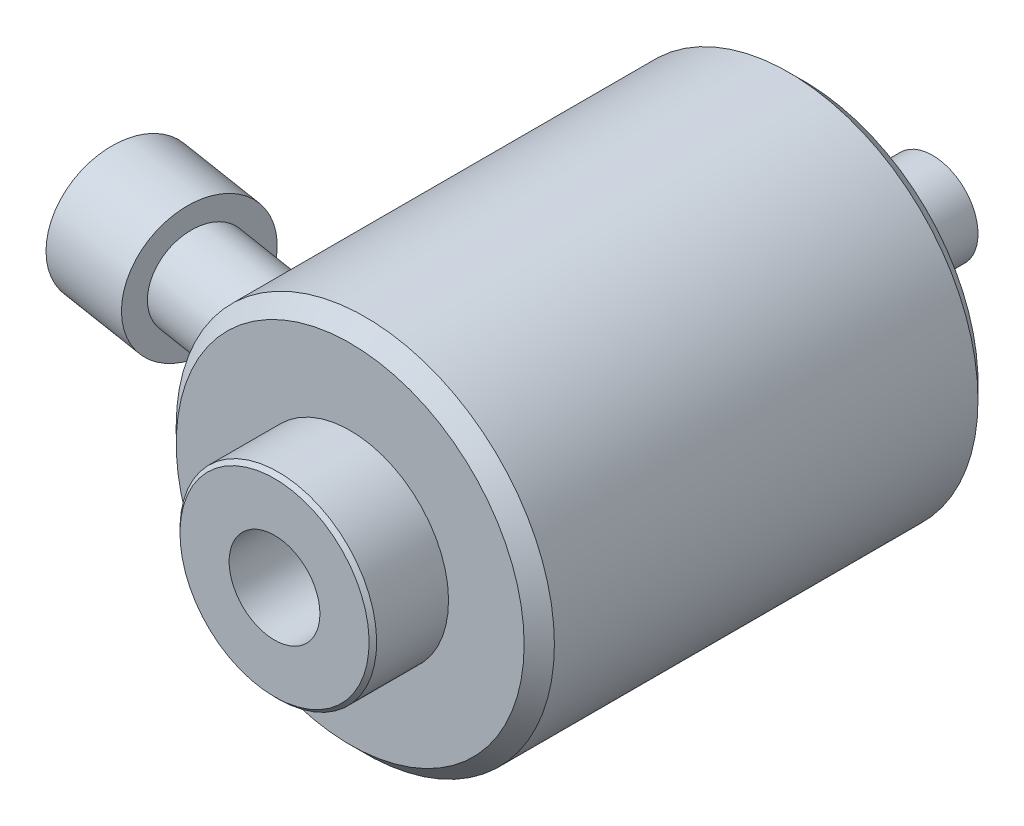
ISO-10303-21;
HEADER;
FILE_DESCRIPTION(('STEP AP214'),'2;1');
FILE_NAME('part.step','',(''),(''),'','','');
FILE_SCHEMA(('AUTOMOTIVE_DESIGN { 1 0 10303 214 1 1 1 1 }'));
ENDSEC;
DATA;
#1=APPLICATION_CONTEXT('core data for automotive mechanical design processes');
#2=APPLICATION_PROTOCOL_DEFINITION('international standard','automotive_design',2000,#1);
#3=PRODUCT_CONTEXT('',#1,'mechanical');
#4=PRODUCT('Part','Part','',(#3));
#5=PRODUCT_RELATED_PRODUCT_CATEGORY('part','',(#4));
#6=PRODUCT_DEFINITION_FORMATION('','',#4);
#7=PRODUCT_DEFINITION_CONTEXT('part definition',#1,'design');
#8=PRODUCT_DEFINITION('design','',#6,#7);
#9=PRODUCT_DEFINITION_SHAPE('','',#8);
#10=(LENGTH_UNIT() NAMED_UNIT(*) SI_UNIT(.MILLI.,.METRE.));
#11=(NAMED_UNIT(*) PLANE_ANGLE_UNIT() SI_UNIT($,.RADIAN.));
#12=(NAMED_UNIT(*) SI_UNIT($,.STERADIAN.) SOLID_ANGLE_UNIT());
#13=UNCERTAINTY_MEASURE_WITH_UNIT(LENGTH_MEASURE(1.E-05),#10,'distance_accuracy_value','');
#14=(GEOMETRIC_REPRESENTATION_CONTEXT(3) GLOBAL_UNCERTAINTY_ASSIGNED_CONTEXT((#13)) GLOBAL_UNIT_ASSIGNED_CONTEXT((#10,
#11,#12)) REPRESENTATION_CONTEXT('',''));
#15=CARTESIAN_POINT('',(0.,0.,0.));
#16=DIRECTION('',(0.,0.,1.));
#17=DIRECTION('',(1.,0.,0.));
#18=AXIS2_PLACEMENT_3D('',#15,#16,#17);
#19=CARTESIAN_POINT('',(0.,0.,60.));
#20=DIRECTION('',(0.,0.,1.));
#21=DIRECTION('',(1.,0.,0.));
#22=AXIS2_PLACEMENT_3D('',#19,#20,#21);
#23=PLANE('',#22);
#24=CARTESIAN_POINT('',(0.,0.,60.));
#25=DIRECTION('',(0.,0.,1.));
#26=DIRECTION('',(1.,0.,0.));
#27=AXIS2_PLACEMENT_3D('',#24,#25,#26);
#28=CIRCLE('',#27,13.);
#29=CARTESIAN_POINT('',(13.,0.,60.));
#30=VERTEX_POINT('',#29);
#31=EDGE_CURVE('P0_E188',#30,#30,#28,.T.);
#32=ORIENTED_EDGE('',*,*,#31,.F.);
#33=EDGE_LOOP('',(#32));
#34=FACE_BOUND('',#33,.T.);
#35=CARTESIAN_POINT('',(0.,0.,60.));
#36=DIRECTION('',(0.,0.,1.));
#37=DIRECTION('',(1.,0.,0.));
#38=AXIS2_PLACEMENT_3D('',#35,#36,#37);
#39=CIRCLE('',#38,23.);
#40=CARTESIAN_POINT('',(23.,0.,60.));
#41=VERTEX_POINT('',#40);
#42=EDGE_CURVE('P0_E489',#41,#41,#39,.F.);
#43=ORIENTED_EDGE('',*,*,#42,.F.);
#44=EDGE_LOOP('',(#43));
#45=FACE_BOUND('',#44,.T.);
#46=ADVANCED_FACE('P0_F15',(#34,#45),#23,.T.);
#47=CARTESIAN_POINT('',(-40.37492091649,8.75,39.5648517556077));
#48=DIRECTION('',(-0.987688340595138,0.,-0.156434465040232));
#49=DIRECTION('',(-0.156434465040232,0.,0.987688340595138));
#50=AXIS2_PLACEMENT_3D('',#47,#48,#49);
#51=PLANE('',#50);
#52=CARTESIAN_POINT('',(-40.37492091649,0.,39.5648517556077));
#53=DIRECTION('',(-0.987688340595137,0.,-0.156434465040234));
#54=DIRECTION('',(-0.156434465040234,0.,0.987688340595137));
#55=AXIS2_PLACEMENT_3D('',#52,#53,#54);
#56=CIRCLE('',#55,6.);
#57=CARTESIAN_POINT('',(-41.3135277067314,0.,45.4909817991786));
#58=VERTEX_POINT('',#57);
#59=EDGE_CURVE('P0_E146',#58,#58,#56,.T.);
#60=ORIENTED_EDGE('',*,*,#59,.T.);
#61=EDGE_LOOP('',(#60));
#62=FACE_BOUND('',#61,.T.);
#63=CARTESIAN_POINT('',(-40.37492091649,0.,39.5648517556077));
#64=DIRECTION('',(-0.987688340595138,0.,-0.156434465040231));
#65=DIRECTION('',(-0.156434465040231,0.,0.987688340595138));
#66=AXIS2_PLACEMENT_3D('',#63,#64,#65);
#67=CIRCLE('',#66,9.);
#68=CARTESIAN_POINT('',(-41.7828311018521,0.,48.4540468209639));
#69=VERTEX_POINT('',#68);
#70=EDGE_CURVE('P0_E482',#69,#69,#67,.T.);
#71=ORIENTED_EDGE('',*,*,#70,.F.);
#72=EDGE_LOOP('',(#71));
#73=FACE_BOUND('',#72,.T.);
#74=ADVANCED_FACE('P0_F226',(#62,#73),#51,.F.);
#75=CARTESIAN_POINT('',(13.,0.,8.));
#76=DIRECTION('',(0.,0.,-1.));
#77=DIRECTION('',(-1.,0.,0.));
#78=AXIS2_PLACEMENT_3D('',#75,#76,#77);
#79=PLANE('',#78);
#80=CARTESIAN_POINT('',(0.,0.,8.));
#81=DIRECTION('',(0.,0.,1.));
#82=DIRECTION('',(1.,0.,0.));
#83=AXIS2_PLACEMENT_3D('',#80,#81,#82);
#84=CIRCLE('',#83,6.5);
#85=CARTESIAN_POINT('',(6.5,0.,8.));
#86=VERTEX_POINT('',#85);
#87=EDGE_CURVE('P0_E195',#86,#86,#84,.T.);
#88=ORIENTED_EDGE('',*,*,#87,.F.);
#89=EDGE_LOOP('',(#88));
#90=FACE_BOUND('',#89,.T.);
#91=CARTESIAN_POINT('',(0.,0.,8.));
#92=DIRECTION('',(0.,0.,1.));
#93=DIRECTION('',(1.,0.,0.));
#94=AXIS2_PLACEMENT_3D('',#91,#92,#93);
#95=CIRCLE('',#94,13.);
#96=CARTESIAN_POINT('',(13.,0.,8.));
#97=VERTEX_POINT('',#96);
#98=EDGE_CURVE('P0_E191',#97,#97,#95,.T.);
#99=ORIENTED_EDGE('',*,*,#98,.T.);
#100=EDGE_LOOP('',(#99));
#101=FACE_BOUND('',#100,.T.);
#102=ADVANCED_FACE('P0_F223',(#90,#101),#79,.F.);
#103=CARTESIAN_POINT('',(0.,0.,0.));
#104=DIRECTION('',(0.,0.,-1.));
#105=DIRECTION('',(-1.,0.,0.));
#106=AXIS2_PLACEMENT_3D('',#103,#104,#105);
#107=CYLINDRICAL_SURFACE('',#106,24.);
#108=DIRECTION('',(0.,0.,-1.));
#109=VECTOR('',#108,1.);
#110=CARTESIAN_POINT('',(-1.25,-23.9674258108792,0.));
#111=LINE('',#110,#109);
#112=CARTESIAN_POINT('',(-1.25,-23.9674258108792,40.721687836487));
#113=VERTEX_POINT('',#112);
#114=CARTESIAN_POINT('',(-1.25,-23.9674258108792,39.278312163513));
#115=VERTEX_POINT('',#114);
#116=EDGE_CURVE('P0_E473',#113,#115,#111,.T.);
#117=ORIENTED_EDGE('',*,*,#116,.T.);
#118=CARTESIAN_POINT('',(0.,0.,38.556624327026));
#119=DIRECTION('',(-0.5,0.,-0.866025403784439));
#120=DIRECTION('',(0.866025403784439,0.,-0.5));
#121=AXIS2_PLACEMENT_3D('',#118,#119,#120);
#122=ELLIPSE('',#121,27.7128129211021,24.);
#123=CARTESIAN_POINT('',(0.,-24.,38.556624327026));
#124=VERTEX_POINT('',#123);
#125=EDGE_CURVE('P0_E151',#115,#124,#122,.F.);
#126=ORIENTED_EDGE('',*,*,#125,.T.);
#127=CARTESIAN_POINT('',(0.,0.,38.556624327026));
#128=DIRECTION('',(0.5,0.,-0.866025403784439));
#129=DIRECTION('',(-0.866025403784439,0.,-0.5));
#130=AXIS2_PLACEMENT_3D('',#127,#128,#129);
#131=ELLIPSE('',#130,27.7128129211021,24.);
#132=CARTESIAN_POINT('',(1.25,-23.9674258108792,39.278312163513));
#133=VERTEX_POINT('',#132);
#134=EDGE_CURVE('P0_E25',#124,#133,#131,.F.);
#135=ORIENTED_EDGE('',*,*,#134,.T.);
#136=DIRECTION('',(0.,0.,-1.));
#137=VECTOR('',#136,1.);
#138=CARTESIAN_POINT('',(1.25,-23.9674258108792,0.));
#139=LINE('',#138,#137);
#140=CARTESIAN_POINT('',(1.25,-23.9674258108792,40.721687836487));
#141=VERTEX_POINT('',#140);
#142=EDGE_CURVE('P0_E140',#133,#141,#139,.F.);
#143=ORIENTED_EDGE('',*,*,#142,.T.);
#144=CARTESIAN_POINT('',(0.,0.,41.4433756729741));
#145=DIRECTION('',(0.5,0.,0.866025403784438));
#146=DIRECTION('',(0.866025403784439,0.,-0.5));
#147=AXIS2_PLACEMENT_3D('',#144,#145,#146);
#148=ELLIPSE('',#147,27.7128129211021,24.);
#149=CARTESIAN_POINT('',(0.,-24.,41.443375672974));
#150=VERTEX_POINT('',#149);
#151=EDGE_CURVE('P0_E145',#141,#150,#148,.F.);
#152=ORIENTED_EDGE('',*,*,#151,.T.);
#153=CARTESIAN_POINT('',(0.,0.,41.443375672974));
#154=DIRECTION('',(-0.5,0.,0.866025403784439));
#155=DIRECTION('',(-0.866025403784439,0.,-0.5));
#156=AXIS2_PLACEMENT_3D('',#153,#154,#155);
#157=ELLIPSE('',#156,27.7128129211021,24.);
#158=EDGE_CURVE('P0_E468',#150,#113,#157,.F.);
#159=ORIENTED_EDGE('',*,*,#158,.T.);
#160=EDGE_LOOP('',(#117,#126,#135,#143,#152,#159));
#161=FACE_BOUND('',#160,.T.);
#162=ADVANCED_FACE('P0_F150',(#161),#107,.T.);
#163=CARTESIAN_POINT('',(0.,0.,0.));
#164=DIRECTION('',(0.,0.,1.));
#165=DIRECTION('',(1.,0.,0.));
#166=AXIS2_PLACEMENT_3D('',#163,#164,#165);
#167=CYLINDRICAL_SURFACE('',#166,13.);
#168=ORIENTED_EDGE('',*,*,#31,.T.);
#169=EDGE_LOOP('',(#168));
#170=FACE_BOUND('',#169,.T.);
#171=ORIENTED_EDGE('',*,*,#98,.F.);
#172=EDGE_LOOP('',(#171));
#173=FACE_BOUND('',#172,.T.);
#174=ADVANCED_FACE('P0_F228',(#170,#173),#167,.F.);
#175=CARTESIAN_POINT('',(0.,0.,0.));
#176=DIRECTION('',(0.,0.,1.));
#177=DIRECTION('',(1.,0.,0.));
#178=AXIS2_PLACEMENT_3D('',#175,#176,#177);
#179=CYLINDRICAL_SURFACE('',#178,6.5);
#180=CARTESIAN_POINT('',(0.,0.,1.));
#181=DIRECTION('',(0.,0.,-1.));
#182=DIRECTION('',(-1.,0.,0.));
#183=AXIS2_PLACEMENT_3D('',#180,#181,#182);
#184=CIRCLE('',#183,6.5);
#185=CARTESIAN_POINT('',(-6.5,0.,1.));
#186=VERTEX_POINT('',#185);
#187=EDGE_CURVE('P0_E159',#186,#186,#184,.T.);
#188=ORIENTED_EDGE('',*,*,#187,.T.);
#189=EDGE_LOOP('',(#188));
#190=FACE_BOUND('',#189,.T.);
#191=ORIENTED_EDGE('',*,*,#87,.T.);
#192=EDGE_LOOP('',(#191));
#193=FACE_BOUND('',#192,.T.);
#194=ADVANCED_FACE('P0_F231',(#190,#193),#179,.F.);
#195=CARTESIAN_POINT('',(1.25,-21.,39.278312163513));
#196=DIRECTION('',(1.,0.,0.));
#197=DIRECTION('',(0.,-1.,0.));
#198=AXIS2_PLACEMENT_3D('',#195,#196,#197);
#199=PLANE('',#198);
#200=ORIENTED_EDGE('',*,*,#142,.F.);
#201=DIRECTION('',(0.,-1.,0.));
#202=VECTOR('',#201,1.);
#203=CARTESIAN_POINT('',(1.25,-21.,39.278312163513));
#204=LINE('',#203,#202);
#205=CARTESIAN_POINT('',(1.25,-24.,39.278312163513));
#206=VERTEX_POINT('',#205);
#207=EDGE_CURVE('P0_E124',#133,#206,#204,.T.);
#208=ORIENTED_EDGE('',*,*,#207,.T.);
#209=DIRECTION('',(0.,0.,1.));
#210=VECTOR('',#209,1.);
#211=CARTESIAN_POINT('',(1.25,-24.,39.278312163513));
#212=LINE('',#211,#210);
#213=CARTESIAN_POINT('',(1.25,-24.,40.721687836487));
#214=VERTEX_POINT('',#213);
#215=EDGE_CURVE('P0_E447',#206,#214,#212,.T.);
#216=ORIENTED_EDGE('',*,*,#215,.T.);
#217=DIRECTION('',(0.,-1.,0.));
#218=VECTOR('',#217,1.);
#219=CARTESIAN_POINT('',(1.25,-21.,40.721687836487));
#220=LINE('',#219,#218);
#221=EDGE_CURVE('P0_E135',#141,#214,#220,.T.);
#222=ORIENTED_EDGE('',*,*,#221,.F.);
#223=EDGE_LOOP('',(#200,#208,#216,#222));
#224=FACE_BOUND('',#223,.T.);
#225=ADVANCED_FACE('P0_F141',(#224),#199,.F.);
#226=CARTESIAN_POINT('',(1.25,-21.,40.721687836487));
#227=DIRECTION('',(0.5,0.,0.866025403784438));
#228=DIRECTION('',(-0.866025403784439,0.,0.5));
#229=AXIS2_PLACEMENT_3D('',#226,#227,#228);
#230=PLANE('',#229);
#231=ORIENTED_EDGE('',*,*,#151,.F.);
#232=ORIENTED_EDGE('',*,*,#221,.T.);
#233=DIRECTION('',(-0.866025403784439,0.,0.5));
#234=VECTOR('',#233,1.);
#235=CARTESIAN_POINT('',(1.25,-24.,40.721687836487));
#236=LINE('',#235,#234);
#237=EDGE_CURVE('P0_E449',#214,#150,#236,.T.);
#238=ORIENTED_EDGE('',*,*,#237,.T.);
#239=EDGE_LOOP('',(#231,#232,#238));
#240=FACE_BOUND('',#239,.T.);
#241=ADVANCED_FACE('P0_F297',(#240),#230,.F.);
#242=CARTESIAN_POINT('',(0.,-21.,41.443375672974));
#243=DIRECTION('',(-0.5,0.,0.866025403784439));
#244=DIRECTION('',(-0.866025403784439,0.,-0.5));
#245=AXIS2_PLACEMENT_3D('',#242,#243,#244);
#246=PLANE('',#245);
#247=ORIENTED_EDGE('',*,*,#158,.F.);
#248=DIRECTION('',(-0.866025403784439,0.,-0.5));
#249=VECTOR('',#248,1.);
#250=CARTESIAN_POINT('',(0.,-24.,41.443375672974));
#251=LINE('',#250,#249);
#252=CARTESIAN_POINT('',(-1.25,-24.,40.721687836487));
#253=VERTEX_POINT('',#252);
#254=EDGE_CURVE('P0_E452',#150,#253,#251,.T.);
#255=ORIENTED_EDGE('',*,*,#254,.T.);
#256=DIRECTION('',(0.,-1.,0.));
#257=VECTOR('',#256,1.);
#258=CARTESIAN_POINT('',(-1.25,-21.,40.721687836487));
#259=LINE('',#258,#257);
#260=EDGE_CURVE('P0_E277',#113,#253,#259,.T.);
#261=ORIENTED_EDGE('',*,*,#260,.F.);
#262=EDGE_LOOP('',(#247,#255,#261));
#263=FACE_BOUND('',#262,.T.);
#264=ADVANCED_FACE('P0_F300',(#263),#246,.F.);
#265=CARTESIAN_POINT('',(-1.25,-21.,40.721687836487));
#266=DIRECTION('',(-1.,0.,0.));
#267=DIRECTION('',(0.,1.,0.));
#268=AXIS2_PLACEMENT_3D('',#265,#266,#267);
#269=PLANE('',#268);
#270=ORIENTED_EDGE('',*,*,#116,.F.);
#271=ORIENTED_EDGE('',*,*,#260,.T.);
#272=DIRECTION('',(0.,0.,-1.));
#273=VECTOR('',#272,1.);
#274=CARTESIAN_POINT('',(-1.25,-24.,40.721687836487));
#275=LINE('',#274,#273);
#276=CARTESIAN_POINT('',(-1.25,-24.,39.278312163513));
#277=VERTEX_POINT('',#276);
#278=EDGE_CURVE('P0_E136',#253,#277,#275,.T.);
#279=ORIENTED_EDGE('',*,*,#278,.T.);
#280=DIRECTION('',(0.,-1.,0.));
#281=VECTOR('',#280,1.);
#282=CARTESIAN_POINT('',(-1.25,-21.,39.278312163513));
#283=LINE('',#282,#281);
#284=EDGE_CURVE('P0_E273',#115,#277,#283,.T.);
#285=ORIENTED_EDGE('',*,*,#284,.F.);
#286=EDGE_LOOP('',(#270,#271,#279,#285));
#287=FACE_BOUND('',#286,.T.);
#288=ADVANCED_FACE('P0_F291',(#287),#269,.F.);
#289=CARTESIAN_POINT('',(-1.25,-21.,39.278312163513));
#290=DIRECTION('',(-0.5,0.,-0.866025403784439));
#291=DIRECTION('',(0.866025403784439,0.,-0.5));
#292=AXIS2_PLACEMENT_3D('',#289,#290,#291);
#293=PLANE('',#292);
#294=ORIENTED_EDGE('',*,*,#125,.F.);
#295=ORIENTED_EDGE('',*,*,#284,.T.);
#296=DIRECTION('',(0.866025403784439,0.,-0.5));
#297=VECTOR('',#296,1.);
#298=CARTESIAN_POINT('',(-1.25,-24.,39.278312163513));
#299=LINE('',#298,#297);
#300=EDGE_CURVE('P0_E442',#277,#124,#299,.T.);
#301=ORIENTED_EDGE('',*,*,#300,.T.);
#302=EDGE_LOOP('',(#294,#295,#301));
#303=FACE_BOUND('',#302,.T.);
#304=ADVANCED_FACE('P0_F288',(#303),#293,.F.);
#305=CARTESIAN_POINT('',(0.,-21.,38.556624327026));
#306=DIRECTION('',(0.5,0.,-0.866025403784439));
#307=DIRECTION('',(0.866025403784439,0.,0.5));
#308=AXIS2_PLACEMENT_3D('',#305,#306,#307);
#309=PLANE('',#308);
#310=ORIENTED_EDGE('',*,*,#134,.F.);
#311=DIRECTION('',(0.866025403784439,0.,0.5));
#312=VECTOR('',#311,1.);
#313=CARTESIAN_POINT('',(0.,-24.,38.556624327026));
#314=LINE('',#313,#312);
#315=EDGE_CURVE('P0_E130',#124,#206,#314,.T.);
#316=ORIENTED_EDGE('',*,*,#315,.T.);
#317=ORIENTED_EDGE('',*,*,#207,.F.);
#318=EDGE_LOOP('',(#310,#316,#317));
#319=FACE_BOUND('',#318,.T.);
#320=ADVANCED_FACE('P0_F126',(#319),#309,.F.);
#321=CARTESIAN_POINT('',(0.,0.,0.));
#322=DIRECTION('',(0.,0.,-1.));
#323=DIRECTION('',(-1.,0.,0.));
#324=AXIS2_PLACEMENT_3D('',#321,#322,#323);
#325=CONICAL_SURFACE('',#324,7.5,0.785398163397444);
#326=ORIENTED_EDGE('',*,*,#187,.F.);
#327=EDGE_LOOP('',(#326));
#328=FACE_BOUND('',#327,.T.);
#329=CARTESIAN_POINT('',(0.,0.,0.));
#330=DIRECTION('',(0.,0.,-1.));
#331=DIRECTION('',(-1.,0.,0.));
#332=AXIS2_PLACEMENT_3D('',#329,#330,#331);
#333=CIRCLE('',#332,7.5);
#334=CARTESIAN_POINT('',(-7.5,0.,0.));
#335=VERTEX_POINT('',#334);
#336=EDGE_CURVE('P0_E165',#335,#335,#333,.F.);
#337=ORIENTED_EDGE('',*,*,#336,.F.);
#338=EDGE_LOOP('',(#337));
#339=FACE_BOUND('',#338,.T.);
#340=ADVANCED_FACE('P0_F17',(#328,#339),#325,.F.);
#341=CARTESIAN_POINT('',(0.,-24.,40.));
#342=DIRECTION('',(0.,-1.,0.));
#343=DIRECTION('',(-1.,0.,0.));
#344=AXIS2_PLACEMENT_3D('',#341,#342,#343);
#345=PLANE('',#344);
#346=ORIENTED_EDGE('',*,*,#315,.F.);
#347=ORIENTED_EDGE('',*,*,#300,.F.);
#348=ORIENTED_EDGE('',*,*,#278,.F.);
#349=ORIENTED_EDGE('',*,*,#254,.F.);
#350=ORIENTED_EDGE('',*,*,#237,.F.);
#351=ORIENTED_EDGE('',*,*,#215,.F.);
#352=EDGE_LOOP('',(#346,#347,#348,#349,#350,#351));
#353=FACE_BOUND('',#352,.T.);
#354=CARTESIAN_POINT('',(0.,-24.,40.));
#355=DIRECTION('',(0.,-1.,0.));
#356=DIRECTION('',(0.,0.,-1.));
#357=AXIS2_PLACEMENT_3D('',#354,#355,#356);
#358=CIRCLE('',#357,2.5);
#359=CARTESIAN_POINT('',(0.,-24.,42.5));
#360=VERTEX_POINT('',#359);
#361=CARTESIAN_POINT('',(0.,-24.,37.5));
#362=VERTEX_POINT('',#361);
#363=EDGE_CURVE('P0_E32',#360,#362,#358,.T.);
#364=ORIENTED_EDGE('',*,*,#363,.T.);
#365=CARTESIAN_POINT('',(0.,-24.,40.));
#366=DIRECTION('',(0.,-1.,0.));
#367=DIRECTION('',(0.,0.,-1.));
#368=AXIS2_PLACEMENT_3D('',#365,#366,#367);
#369=CIRCLE('',#368,2.5);
#370=EDGE_CURVE('P0_E19',#362,#360,#369,.T.);
#371=ORIENTED_EDGE('',*,*,#370,.T.);
#372=EDGE_LOOP('',(#364,#371));
#373=FACE_BOUND('',#372,.T.);
#374=ADVANCED_FACE('P0_F246',(#353,#373),#345,.T.);
#375=CARTESIAN_POINT('',(-24.,0.,16.4239658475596));
#376=CARTESIAN_POINT('',(-23.9999995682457,0.0698849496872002,16.4239627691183));
#377=CARTESIAN_POINT('',(-23.999691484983,0.139819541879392,16.4180606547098));
#378=CARTESIAN_POINT('',(-23.9984921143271,0.27775823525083,16.3946000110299));
#379=CARTESIAN_POINT('',(-23.9976001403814,0.345759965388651,16.3770277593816));
#380=CARTESIAN_POINT('',(-23.9953340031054,0.47781292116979,16.3307343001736));
#381=CARTESIAN_POINT('',(-23.9939600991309,0.54186624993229,16.3020190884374));
#382=CARTESIAN_POINT('',(-23.9908847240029,0.66422964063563,16.2342713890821));
#383=CARTESIAN_POINT('',(-23.9891833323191,0.72254109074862,16.1952414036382));
#384=CARTESIAN_POINT('',(-23.9856402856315,0.831903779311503,16.1079054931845));
#385=CARTESIAN_POINT('',(-23.9837983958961,0.882942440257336,16.0595838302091));
#386=CARTESIAN_POINT('',(-23.9801825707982,0.976232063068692,15.9550914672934));
#387=CARTESIAN_POINT('',(-23.9784086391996,1.01848253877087,15.8989203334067));
#388=CARTESIAN_POINT('',(-23.9751166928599,1.09324858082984,15.7800193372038));
#389=CARTESIAN_POINT('',(-23.9736000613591,1.12571221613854,15.7172567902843));
#390=CARTESIAN_POINT('',(-23.9710015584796,1.17975422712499,15.5872016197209));
#391=CARTESIAN_POINT('',(-23.9699197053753,1.20133214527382,15.5199088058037));
#392=CARTESIAN_POINT('',(-23.9683010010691,1.23321002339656,15.3820644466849));
#393=CARTESIAN_POINT('',(-23.9677690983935,1.24340764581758,15.3114891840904));
#394=CARTESIAN_POINT('',(-23.9673240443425,1.25195713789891,15.1696230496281));
#395=CARTESIAN_POINT('',(-23.9674109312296,1.25030827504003,15.0983321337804));
#396=CARTESIAN_POINT('',(-23.9681955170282,1.23517647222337,14.956272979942));
#397=CARTESIAN_POINT('',(-23.9688995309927,1.22157117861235,14.8855177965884));
#398=CARTESIAN_POINT('',(-23.9708460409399,1.18275710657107,14.7472702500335));
#399=CARTESIAN_POINT('',(-23.9720885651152,1.15754772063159,14.6797780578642));
#400=CARTESIAN_POINT('',(-23.9749795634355,1.09604005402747,14.5495979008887));
#401=CARTESIAN_POINT('',(-23.9766302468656,1.05968115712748,14.4869386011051));
#402=CARTESIAN_POINT('',(-23.9801453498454,0.976902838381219,14.3686627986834));
#403=CARTESIAN_POINT('',(-23.9820097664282,0.93048355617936,14.3130461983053));
#404=CARTESIAN_POINT('',(-23.985726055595,0.829152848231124,14.2108361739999));
#405=CARTESIAN_POINT('',(-23.9875779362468,0.774294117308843,14.1641905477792));
#406=CARTESIAN_POINT('',(-23.9910657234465,0.657401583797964,14.0809636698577));
#407=CARTESIAN_POINT('',(-23.9927016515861,0.59536849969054,14.0443814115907));
#408=CARTESIAN_POINT('',(-23.995539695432,0.467031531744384,13.9830102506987));
#409=CARTESIAN_POINT('',(-23.9967488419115,0.400820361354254,13.9580278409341));
#410=CARTESIAN_POINT('',(-23.9986317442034,0.265094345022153,13.9197557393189));
#411=CARTESIAN_POINT('',(-23.9993055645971,0.195579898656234,13.9064646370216));
#412=CARTESIAN_POINT('',(-24.0000321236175,0.0565769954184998,13.892154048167));
#413=CARTESIAN_POINT('',(-24.0000959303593,-0.012888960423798,13.8909158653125));
#414=CARTESIAN_POINT('',(-23.9996241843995,-0.151028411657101,13.9001811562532));
#415=CARTESIAN_POINT('',(-23.9990886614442,-0.219701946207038,13.9106840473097));
#416=CARTESIAN_POINT('',(-23.9974839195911,-0.353901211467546,13.942989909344));
#417=CARTESIAN_POINT('',(-23.9964178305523,-0.419442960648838,13.9647266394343));
#418=CARTESIAN_POINT('',(-23.9938720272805,-0.545999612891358,14.0187731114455));
#419=CARTESIAN_POINT('',(-23.9923922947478,-0.607014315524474,14.0510833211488));
#420=CARTESIAN_POINT('',(-23.9891636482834,-0.723508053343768,14.1256912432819));
#421=CARTESIAN_POINT('',(-23.9874120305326,-0.77892107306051,14.1680918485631));
#422=CARTESIAN_POINT('',(-23.9838430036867,-0.882009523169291,14.2614340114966));
#423=CARTESIAN_POINT('',(-23.9820255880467,-0.929684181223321,14.3123764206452));
#424=CARTESIAN_POINT('',(-23.9784870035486,-1.01691101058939,14.4224090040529));
#425=CARTESIAN_POINT('',(-23.9767683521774,-1.05628968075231,14.4816368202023));
#426=CARTESIAN_POINT('',(-23.9736559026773,-1.12472242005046,14.6057922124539));
#427=CARTESIAN_POINT('',(-23.9722621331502,-1.15377558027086,14.6707202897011));
#428=CARTESIAN_POINT('',(-23.9699359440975,-1.20114347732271,14.8054820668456));
#429=CARTESIAN_POINT('',(-23.9690107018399,-1.21929190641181,14.8753744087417));
#430=CARTESIAN_POINT('',(-23.9677592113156,-1.24365151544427,15.0172165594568));
#431=CARTESIAN_POINT('',(-23.9674329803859,-1.24986234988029,15.089166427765));
#432=CARTESIAN_POINT('',(-23.9674188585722,-1.25013348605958,15.2332969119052));
#433=CARTESIAN_POINT('',(-23.967732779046,-1.24415930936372,15.3054776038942));
#434=CARTESIAN_POINT('',(-23.9689695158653,-1.22009982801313,15.4477879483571));
#435=CARTESIAN_POINT('',(-23.9698923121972,-1.20201492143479,15.5179176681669));
#436=CARTESIAN_POINT('',(-23.9722338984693,-1.15436673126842,15.6535718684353));
#437=CARTESIAN_POINT('',(-23.9736489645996,-1.12488944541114,15.7191266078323));
#438=CARTESIAN_POINT('',(-23.976815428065,-1.05524003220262,15.8442734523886));
#439=CARTESIAN_POINT('',(-23.9785667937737,-1.015068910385,15.903866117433));
#440=CARTESIAN_POINT('',(-23.9821846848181,-0.925631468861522,16.0147341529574));
#441=CARTESIAN_POINT('',(-23.9840497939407,-0.876465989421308,16.0660909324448));
#442=CARTESIAN_POINT('',(-23.987699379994,-0.77013086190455,16.1597494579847));
#443=CARTESIAN_POINT('',(-23.9894838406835,-0.712959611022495,16.2020493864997));
#444=CARTESIAN_POINT('',(-23.992754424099,-0.592724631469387,16.2760525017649));
#445=CARTESIAN_POINT('',(-23.9942426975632,-0.529708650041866,16.3078332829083));
#446=CARTESIAN_POINT('',(-23.9967670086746,-0.399262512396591,16.3602848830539));
#447=CARTESIAN_POINT('',(-23.9978035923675,-0.33183779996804,16.3809691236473));
#448=CARTESIAN_POINT('',(-23.9990308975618,-0.219988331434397,16.4051716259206));
#449=CARTESIAN_POINT('',(-23.9993927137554,-0.176295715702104,16.4122104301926));
#450=CARTESIAN_POINT('',(-23.999877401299,-0.0884086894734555,16.4216085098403));
#451=CARTESIAN_POINT('',(-24.0000002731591,-0.0442142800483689,16.4239677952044));
#452=CARTESIAN_POINT('',(-24.,0.,16.4239658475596));
#453=B_SPLINE_CURVE_WITH_KNOTS('',3,(#375,#376,#377,#378,#379,#380,#381,#382,#383,#384,#385,
#386,#387,#388,#389,#390,#391,#392,#393,#394,#395,#396,#397,#398,#399,#400,#401,#402,#403,#404,
#405,#406,#407,#408,#409,#410,#411,#412,#413,#414,#415,#416,#417,#418,#419,#420,#421,#422,#423,
#424,#425,#426,#427,#428,#429,#430,#431,#432,#433,#434,#435,#436,#437,#438,#439,#440,#441,#442,
#443,#444,#445,#446,#447,#448,#449,#450,#451,#452),.UNSPECIFIED.,.T.,.F.,(4,2,2,2,2,2,2,2,2,2,2,
2,2,2,2,2,2,2,2,2,2,2,2,2,2,2,2,2,2,2,2,2,2,2,2,2,2,2,4),(0.,0.209493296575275,
0.419233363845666,0.628860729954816,0.838437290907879,1.04837200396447,1.2583183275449,
1.46935981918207,1.68041018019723,1.89334349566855,2.10628997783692,2.3214413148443,
2.53660391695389,2.75295767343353,2.96930842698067,3.1843593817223,3.39938881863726,
3.6106894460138,3.8219645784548,4.02939888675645,4.23682290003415,4.44303755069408,
4.64926132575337,4.85768561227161,5.06613068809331,5.27857737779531,5.49104276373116,
5.70667123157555,5.92230594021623,6.13855165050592,6.35479025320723,6.56942744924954,
6.78404447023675,6.99638833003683,7.20877476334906,7.41955767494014,7.63008506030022,
7.76262597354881,7.89516660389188),.UNSPECIFIED.);
#454=CARTESIAN_POINT('',(-24.,0.,16.4239658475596));
#455=VERTEX_POINT('',#454);
#456=EDGE_CURVE('P0_E10',#455,#455,#453,.T.);
#457=ORIENTED_EDGE('',*,*,#456,.T.);
#458=EDGE_LOOP('',(#457));
#459=FACE_BOUND('',#458,.T.);
#460=ADVANCED_FACE('P0_F240',(#459),#107,.T.);
#461=CARTESIAN_POINT('',(25.,0.,0.));
#462=DIRECTION('',(0.,0.,-1.));
#463=DIRECTION('',(-1.,0.,0.));
#464=AXIS2_PLACEMENT_3D('',#461,#462,#463);
#465=PLANE('',#464);
#466=ORIENTED_EDGE('',*,*,#336,.T.);
#467=EDGE_LOOP('',(#466));
#468=FACE_BOUND('',#467,.T.);
#469=CARTESIAN_POINT('',(0.,0.,0.));
#470=DIRECTION('',(0.,0.,-1.));
#471=DIRECTION('',(-1.,0.,0.));
#472=AXIS2_PLACEMENT_3D('',#469,#470,#471);
#473=CIRCLE('',#472,23.);
#474=CARTESIAN_POINT('',(-23.,0.,0.));
#475=VERTEX_POINT('',#474);
#476=EDGE_CURVE('P0_E172',#475,#475,#473,.T.);
#477=ORIENTED_EDGE('',*,*,#476,.T.);
#478=EDGE_LOOP('',(#477));
#479=FACE_BOUND('',#478,.T.);
#480=ADVANCED_FACE('P0_F237',(#468,#479),#465,.T.);
#481=CARTESIAN_POINT('',(0.,-10.,40.));
#482=DIRECTION('',(0.,-1.,0.));
#483=DIRECTION('',(0.,0.,-1.));
#484=AXIS2_PLACEMENT_3D('',#481,#482,#483);
#485=CYLINDRICAL_SURFACE('',#484,2.5);
#486=ORIENTED_EDGE('',*,*,#370,.F.);
#487=ORIENTED_EDGE('',*,*,#363,.F.);
#488=EDGE_LOOP('',(#486,#487));
#489=FACE_BOUND('',#488,.T.);
#490=CARTESIAN_POINT('',(0.,-25.,37.5));
#491=CARTESIAN_POINT('',(-0.140050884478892,-24.9999983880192,37.5000060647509));
#492=CARTESIAN_POINT('',(-0.280194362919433,-24.9988106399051,37.5118081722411));
#493=CARTESIAN_POINT('',(-0.556595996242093,-24.9941866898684,37.5587109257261));
#494=CARTESIAN_POINT('',(-0.69284969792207,-24.9907480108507,37.5938372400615));
#495=CARTESIAN_POINT('',(-0.957429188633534,-24.9820103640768,37.6863556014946));
#496=CARTESIAN_POINT('',(-1.08575971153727,-24.9767125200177,37.7437342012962));
#497=CARTESIAN_POINT('',(-1.33094040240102,-24.9648489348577,37.8791022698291));
#498=CARTESIAN_POINT('',(-1.4477928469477,-24.9582834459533,37.9570876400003));
#499=CARTESIAN_POINT('',(-1.66714887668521,-24.9445936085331,38.1317567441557));
#500=CARTESIAN_POINT('',(-1.76960536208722,-24.9374675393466,38.2284994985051));
#501=CARTESIAN_POINT('',(-1.95685630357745,-24.9234739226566,38.4378113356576));
#502=CARTESIAN_POINT('',(-2.04164994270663,-24.9166063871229,38.5503811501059));
#503=CARTESIAN_POINT('',(-2.19133492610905,-24.9038897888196,38.788446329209));
#504=CARTESIAN_POINT('',(-2.25618366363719,-24.8980429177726,38.9139686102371));
#505=CARTESIAN_POINT('',(-2.36386596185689,-24.8880509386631,39.1741889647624));
#506=CARTESIAN_POINT('',(-2.40670006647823,-24.8839057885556,39.3088868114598));
#507=CARTESIAN_POINT('',(-2.46899760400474,-24.8778021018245,39.583154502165));
#508=CARTESIAN_POINT('',(-2.48853913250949,-24.8758362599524,39.7227064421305));
#509=CARTESIAN_POINT('',(-2.5039382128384,-24.8742910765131,40.0031221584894));
#510=CARTESIAN_POINT('',(-2.49979638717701,-24.8747116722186,40.1439859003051));
#511=CARTESIAN_POINT('',(-2.4680107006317,-24.8778851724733,40.4224882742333));
#512=CARTESIAN_POINT('',(-2.44045211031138,-24.8806296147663,40.5601367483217));
#513=CARTESIAN_POINT('',(-2.36274786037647,-24.8881283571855,40.8288449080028));
#514=CARTESIAN_POINT('',(-2.31260189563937,-24.8928826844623,40.9599045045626));
#515=CARTESIAN_POINT('',(-2.19105223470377,-24.9038752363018,41.2119839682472));
#516=CARTESIAN_POINT('',(-2.11961070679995,-24.9101160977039,41.3329854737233));
#517=CARTESIAN_POINT('',(-1.95752506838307,-24.923376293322,41.5613130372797));
#518=CARTESIAN_POINT('',(-1.86688039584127,-24.9303956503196,41.6686386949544));
#519=CARTESIAN_POINT('',(-1.66848528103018,-24.9444596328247,41.8670634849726));
#520=CARTESIAN_POINT('',(-1.56066119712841,-24.9515042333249,41.958089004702));
#521=CARTESIAN_POINT('',(-1.33122370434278,-24.964795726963,42.120759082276));
#522=CARTESIAN_POINT('',(-1.209610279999,-24.9710426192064,42.1924036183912));
#523=CARTESIAN_POINT('',(-0.955995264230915,-24.9820368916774,42.3142750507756));
#524=CARTESIAN_POINT('',(-0.823991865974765,-24.9867840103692,42.3644982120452));
#525=CARTESIAN_POINT('',(-0.553368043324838,-24.9942411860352,42.4420472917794));
#526=CARTESIAN_POINT('',(-0.414747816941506,-24.9969513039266,42.4693738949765));
#527=CARTESIAN_POINT('',(-0.135462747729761,-25.0000212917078,42.5002607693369));
#528=CARTESIAN_POINT('',(0.00519075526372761,-25.0003912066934,42.5039226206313));
#529=CARTESIAN_POINT('',(0.285109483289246,-24.9987660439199,42.4876428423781));
#530=CARTESIAN_POINT('',(0.42437472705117,-24.9967709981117,42.4677015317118));
#531=CARTESIAN_POINT('',(0.697270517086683,-24.9906465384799,42.404865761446));
#532=CARTESIAN_POINT('',(0.830912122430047,-24.986521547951,42.362018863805));
#533=CARTESIAN_POINT('',(1.08911080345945,-24.9765999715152,42.2546370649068));
#534=CARTESIAN_POINT('',(1.21366767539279,-24.9708033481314,42.1901016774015));
#535=CARTESIAN_POINT('',(1.45062045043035,-24.9581618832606,42.0409229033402));
#536=CARTESIAN_POINT('',(1.56297414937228,-24.951313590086,41.9562127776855));
#537=CARTESIAN_POINT('',(1.77190405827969,-24.937348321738,41.7691848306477));
#538=CARTESIAN_POINT('',(1.86847987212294,-24.9302313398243,41.6668665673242));
#539=CARTESIAN_POINT('',(2.04346527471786,-24.9165006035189,41.4470835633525));
#540=CARTESIAN_POINT('',(2.12180819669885,-24.9098887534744,41.3295656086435));
#541=CARTESIAN_POINT('',(2.25764564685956,-24.8979458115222,41.0829815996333));
#542=CARTESIAN_POINT('',(2.3151404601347,-24.892614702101,40.953915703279));
#543=CARTESIAN_POINT('',(2.40753802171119,-24.8838486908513,40.6881281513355));
#544=CARTESIAN_POINT('',(2.44248043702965,-24.8804104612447,40.5514203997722));
#545=CARTESIAN_POINT('',(2.48891001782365,-24.8758091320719,40.2740420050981));
#546=CARTESIAN_POINT('',(2.50039785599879,-24.8746459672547,40.1333714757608));
#547=CARTESIAN_POINT('',(2.49958284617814,-24.8747278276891,39.8527232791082));
#548=CARTESIAN_POINT('',(2.48738472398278,-24.8759622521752,39.712745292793));
#549=CARTESIAN_POINT('',(2.43976363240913,-24.8806775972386,39.4368377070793));
#550=CARTESIAN_POINT('',(2.4043406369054,-24.884158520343,39.3009081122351));
#551=CARTESIAN_POINT('',(2.31130421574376,-24.8929717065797,39.0369566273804));
#552=CARTESIAN_POINT('',(2.25369386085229,-24.898303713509,38.9089336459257));
#553=CARTESIAN_POINT('',(2.11792888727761,-24.910218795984,38.6643577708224));
#554=CARTESIAN_POINT('',(2.03977438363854,-24.9168018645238,38.5478048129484));
#555=CARTESIAN_POINT('',(1.86474639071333,-24.9305121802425,38.3289408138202));
#556=CARTESIAN_POINT('',(1.76779487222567,-24.9376416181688,38.2266923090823));
#557=CARTESIAN_POINT('',(1.55807924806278,-24.9516213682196,38.0398694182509));
#558=CARTESIAN_POINT('',(1.44531136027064,-24.9584716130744,37.9552992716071));
#559=CARTESIAN_POINT('',(1.20685358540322,-24.9711390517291,37.8060663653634));
#560=CARTESIAN_POINT('',(1.0811318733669,-24.9769536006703,37.741454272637));
#561=CARTESIAN_POINT('',(0.820645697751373,-24.9868657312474,37.6343439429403));
#562=CARTESIAN_POINT('',(0.685891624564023,-24.9909652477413,37.5918207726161));
#563=CARTESIAN_POINT('',(0.458645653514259,-24.9959553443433,37.540698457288));
#564=CARTESIAN_POINT('',(0.367606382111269,-24.9974650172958,37.5254573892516));
#565=CARTESIAN_POINT('',(0.18439145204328,-24.9994878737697,37.5051061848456));
#566=CARTESIAN_POINT('',(0.0922157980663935,-25.0000010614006,37.4999960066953));
#567=CARTESIAN_POINT('',(0.,-25.,37.5));
#568=B_SPLINE_CURVE_WITH_KNOTS('',3,(#490,#491,#492,#493,#494,#495,#496,#497,#498,#499,#500,
#501,#502,#503,#504,#505,#506,#507,#508,#509,#510,#511,#512,#513,#514,#515,#516,#517,#518,#519,
#520,#521,#522,#523,#524,#525,#526,#527,#528,#529,#530,#531,#532,#533,#534,#535,#536,#537,#538,
#539,#540,#541,#542,#543,#544,#545,#546,#547,#548,#549,#550,#551,#552,#553,#554,#555,#556,#557,
#558,#559,#560,#561,#562,#563,#564,#565,#566,#567),.UNSPECIFIED.,.T.,.F.,(4,2,2,2,2,2,2,2,2,2,2,
2,2,2,2,2,2,2,2,2,2,2,2,2,2,2,2,2,2,2,2,2,2,2,2,2,2,2,4),(0.,0.419815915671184,
0.840094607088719,1.2601197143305,1.68006134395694,2.10134642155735,2.52265098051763,
2.94484938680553,3.36703736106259,3.78780580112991,4.20856318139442,4.62779493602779,
5.04703235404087,5.46701903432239,5.88701800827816,6.30886835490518,6.7307191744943,
7.15264351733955,7.574555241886,7.99465471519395,8.4147485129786,8.83397338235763,
9.25320765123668,9.67384851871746,10.0944999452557,10.516666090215,10.9388264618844,
11.3602422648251,11.7816459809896,12.2011907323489,12.620735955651,13.04022313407,
13.459707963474,13.8809729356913,14.302338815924,14.7247657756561,15.1467148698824,
15.4231416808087,15.6995673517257),.UNSPECIFIED.);
#569=CARTESIAN_POINT('',(0.,-25.,37.5));
#570=VERTEX_POINT('',#569);
#571=EDGE_CURVE('P0_E270',#570,#570,#568,.T.);
#572=ORIENTED_EDGE('',*,*,#571,.F.);
#573=EDGE_LOOP('',(#572));
#574=FACE_BOUND('',#573,.T.);
#575=ADVANCED_FACE('P0_F239',(#489,#574),#485,.F.);
#576=CARTESIAN_POINT('',(-37.2997519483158,0.,13.0519106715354));
#577=DIRECTION('',(-0.987688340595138,0.,-0.156434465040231));
#578=DIRECTION('',(-0.156434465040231,0.,0.987688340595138));
#579=AXIS2_PLACEMENT_3D('',#576,#577,#578);
#580=CYLINDRICAL_SURFACE('',#579,1.25);
#581=CARTESIAN_POINT('',(-25.,0.,16.265581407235));
#582=CARTESIAN_POINT('',(-24.9999995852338,0.0698742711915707,16.265578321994));
#583=CARTESIAN_POINT('',(-24.9997039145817,0.139798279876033,16.2596760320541));
#584=CARTESIAN_POINT('',(-24.9985528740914,0.277715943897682,16.236215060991));
#585=CARTESIAN_POINT('',(-24.9976968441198,0.345707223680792,16.2186426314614));
#586=CARTESIAN_POINT('',(-24.9955220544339,0.477739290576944,16.172350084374));
#587=CARTESIAN_POINT('',(-24.9942035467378,0.54178220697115,16.1436360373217));
#588=CARTESIAN_POINT('',(-24.9912521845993,0.664126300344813,16.0758932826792));
#589=CARTESIAN_POINT('',(-24.9896194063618,0.722428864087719,16.036867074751));
#590=CARTESIAN_POINT('',(-24.9862189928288,0.831783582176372,15.949537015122));
#591=CARTESIAN_POINT('',(-24.9844511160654,0.882822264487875,15.9012163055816));
#592=CARTESIAN_POINT('',(-24.9809804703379,0.976114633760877,15.7967279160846));
#593=CARTESIAN_POINT('',(-24.9792777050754,1.0183678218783,15.7405597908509));
#594=CARTESIAN_POINT('',(-24.9761172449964,1.09315188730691,15.6216526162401));
#595=CARTESIAN_POINT('',(-24.9746609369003,1.12562850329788,15.5588794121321));
#596=CARTESIAN_POINT('',(-24.9721656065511,1.17969538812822,15.4288018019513));
#597=CARTESIAN_POINT('',(-24.9711266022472,1.20128518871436,15.3614972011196));
#598=CARTESIAN_POINT('',(-24.969571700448,1.23318664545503,15.2236197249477));
#599=CARTESIAN_POINT('',(-24.9690606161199,1.24339459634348,15.1530228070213));
#600=CARTESIAN_POINT('',(-24.9686327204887,1.25195792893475,15.0111121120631));
#601=CARTESIAN_POINT('',(-24.9687159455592,1.25031258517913,14.9397982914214));
#602=CARTESIAN_POINT('',(-24.9694691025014,1.23518014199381,14.7977042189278));
#603=CARTESIAN_POINT('',(-24.9701450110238,1.22157240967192,14.7269368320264));
#604=CARTESIAN_POINT('',(-24.9720140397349,1.18274648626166,14.5886667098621));
#605=CARTESIAN_POINT('',(-24.973207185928,1.15752771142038,14.5211641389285));
#606=CARTESIAN_POINT('',(-24.9759829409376,1.09600410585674,14.3909888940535));
#607=CARTESIAN_POINT('',(-24.9775675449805,1.05964224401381,14.3283431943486));
#608=CARTESIAN_POINT('',(-24.9809418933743,0.976858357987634,14.210096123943));
#609=CARTESIAN_POINT('',(-24.9827316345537,0.930436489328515,14.1544946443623));
#610=CARTESIAN_POINT('',(-24.9862986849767,0.829111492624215,14.0523251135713));
#611=CARTESIAN_POINT('',(-24.9880760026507,0.774262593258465,14.0057033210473));
#612=CARTESIAN_POINT('',(-24.991423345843,0.657395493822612,13.9225198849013));
#613=CARTESIAN_POINT('',(-24.9929933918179,0.595378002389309,13.8859572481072));
#614=CARTESIAN_POINT('',(-24.995717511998,0.467064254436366,13.8246112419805));
#615=CARTESIAN_POINT('',(-24.9968782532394,0.400859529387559,13.7996367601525));
#616=CARTESIAN_POINT('',(-24.9986858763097,0.265149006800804,13.7613751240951));
#617=CARTESIAN_POINT('',(-24.9993328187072,0.195643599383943,13.7480865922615));
#618=CARTESIAN_POINT('',(-25.000030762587,0.0566320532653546,13.7337713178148));
#619=CARTESIAN_POINT('',(-25.0000921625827,-0.0128520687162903,13.7325306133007));
#620=CARTESIAN_POINT('',(-24.9996392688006,-0.15102834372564,13.7417932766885));
#621=CARTESIAN_POINT('',(-24.9991250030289,-0.219720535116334,13.7522960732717));
#622=CARTESIAN_POINT('',(-24.9975837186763,-0.353966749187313,13.7846075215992));
#623=CARTESIAN_POINT('',(-24.9965596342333,-0.419536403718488,13.8063515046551));
#624=CARTESIAN_POINT('',(-24.994114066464,-0.546146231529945,13.860420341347));
#625=CARTESIAN_POINT('',(-24.992692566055,-0.607186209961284,13.8927456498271));
#626=CARTESIAN_POINT('',(-24.9895914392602,-0.723710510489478,13.9673830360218));
#627=CARTESIAN_POINT('',(-24.9879092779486,-0.779130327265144,14.0097956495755));
#628=CARTESIAN_POINT('',(-24.9844820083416,-0.882227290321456,14.1031657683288));
#629=CARTESIAN_POINT('',(-24.9827368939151,-0.929903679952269,14.1541241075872));
#630=CARTESIAN_POINT('',(-24.9793400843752,-1.01711066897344,14.2641714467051));
#631=CARTESIAN_POINT('',(-24.9776907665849,-1.05647101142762,14.3233954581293));
#632=CARTESIAN_POINT('',(-24.9747042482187,-1.12486625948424,14.4475403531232));
#633=CARTESIAN_POINT('',(-24.9733670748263,-1.153900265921,14.5124617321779));
#634=CARTESIAN_POINT('',(-24.9711358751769,-1.20122718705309,14.6471989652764));
#635=CARTESIAN_POINT('',(-24.9702486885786,-1.21935505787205,14.7170729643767));
#636=CARTESIAN_POINT('',(-24.969049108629,-1.24367874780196,14.8588746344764));
#637=CARTESIAN_POINT('',(-24.9687367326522,-1.24987420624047,14.9308023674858));
#638=CARTESIAN_POINT('',(-24.968724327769,-1.25012236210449,15.0749034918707));
#639=CARTESIAN_POINT('',(-24.9690261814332,-1.24413772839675,15.1470769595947));
#640=CARTESIAN_POINT('',(-24.9702141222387,-1.22006151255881,15.2893723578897));
#641=CARTESIAN_POINT('',(-24.971100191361,-1.20197030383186,15.3594943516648));
#642=CARTESIAN_POINT('',(-24.9733485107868,-1.15430725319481,15.4951557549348));
#643=CARTESIAN_POINT('',(-24.9747073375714,-1.12481778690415,15.560724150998));
#644=CARTESIAN_POINT('',(-24.9777477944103,-1.05514237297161,15.6858971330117));
#645=CARTESIAN_POINT('',(-24.9794293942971,-1.01495742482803,15.7455022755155));
#646=CARTESIAN_POINT('',(-24.9829031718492,-0.925487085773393,15.8563976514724));
#647=CARTESIAN_POINT('',(-24.9846940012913,-0.876301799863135,15.9077687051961));
#648=CARTESIAN_POINT('',(-24.9881980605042,-0.76992387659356,16.0014506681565));
#649=CARTESIAN_POINT('',(-24.9899112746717,-0.712729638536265,16.0437597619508));
#650=CARTESIAN_POINT('',(-24.9930507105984,-0.592456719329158,16.1177672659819));
#651=CARTESIAN_POINT('',(-24.9944790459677,-0.529426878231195,16.1495450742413));
#652=CARTESIAN_POINT('',(-24.9969013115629,-0.398953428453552,16.2019848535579));
#653=CARTESIAN_POINT('',(-24.9978957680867,-0.33151528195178,16.2226602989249));
#654=CARTESIAN_POINT('',(-24.9990720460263,-0.21970683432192,16.2468294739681));
#655=CARTESIAN_POINT('',(-24.9994185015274,-0.176069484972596,16.2538524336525));
#656=CARTESIAN_POINT('',(-24.9998826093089,-0.0882947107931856,16.2632293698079));
#657=CARTESIAN_POINT('',(-25.0000002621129,-0.0441572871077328,16.2655833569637));
#658=CARTESIAN_POINT('',(-25.,0.,16.265581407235));
#659=B_SPLINE_CURVE_WITH_KNOTS('',3,(#581,#582,#583,#584,#585,#586,#587,#588,#589,#590,#591,
#592,#593,#594,#595,#596,#597,#598,#599,#600,#601,#602,#603,#604,#605,#606,#607,#608,#609,#610,
#611,#612,#613,#614,#615,#616,#617,#618,#619,#620,#621,#622,#623,#624,#625,#626,#627,#628,#629,
#630,#631,#632,#633,#634,#635,#636,#637,#638,#639,#640,#641,#642,#643,#644,#645,#646,#647,#648,
#649,#650,#651,#652,#653,#654,#655,#656,#657,#658),.UNSPECIFIED.,.T.,.F.,(4,2,2,2,2,2,2,2,2,2,2,
2,2,2,2,2,2,2,2,2,2,2,2,2,2,2,2,2,2,2,2,2,2,2,2,2,2,2,4),(0.,0.209461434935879,
0.419170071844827,0.628764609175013,0.838308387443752,1.04823587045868,1.25817526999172,
1.4692592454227,1.68035229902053,1.89335338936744,2.10636751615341,2.32155471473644,
2.53675273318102,2.75307108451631,2.96938609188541,3.18436328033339,3.39931923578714,
3.61059172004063,3.82183929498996,4.02932823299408,4.23680707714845,4.44310539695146,
4.6494125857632,4.85786912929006,5.06634602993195,5.27874786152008,5.49116818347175,
5.70672712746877,5.92229258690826,6.13851973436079,6.35474021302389,6.569426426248,
6.78409258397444,6.99650215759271,7.208954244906,7.41976609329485,7.63032150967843,
7.76269169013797,7.89506156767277),.UNSPECIFIED.);
#660=CARTESIAN_POINT('',(-25.,0.,16.265581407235));
#661=VERTEX_POINT('',#660);
#662=EDGE_CURVE('P0_E208',#661,#661,#659,.T.);
#663=ORIENTED_EDGE('',*,*,#662,.T.);
#664=EDGE_LOOP('',(#663));
#665=FACE_BOUND('',#664,.T.);
#666=ORIENTED_EDGE('',*,*,#456,.F.);
#667=EDGE_LOOP('',(#666));
#668=FACE_BOUND('',#667,.T.);
#669=ADVANCED_FACE('P0_F220',(#665,#668),#580,.F.);
#670=CARTESIAN_POINT('',(0.,0.,60.));
#671=DIRECTION('',(0.,0.,-1.));
#672=DIRECTION('',(-1.,0.,0.));
#673=AXIS2_PLACEMENT_3D('',#670,#671,#672);
#674=CONICAL_SURFACE('',#673,23.,0.785398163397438);
#675=CARTESIAN_POINT('',(0.,0.,58.));
#676=DIRECTION('',(0.,0.,1.));
#677=DIRECTION('',(1.,0.,0.));
#678=AXIS2_PLACEMENT_3D('',#675,#676,#677);
#679=CIRCLE('',#678,25.);
#680=CARTESIAN_POINT('',(25.,0.,58.));
#681=VERTEX_POINT('',#680);
#682=EDGE_CURVE('P0_E184',#681,#681,#679,.F.);
#683=ORIENTED_EDGE('',*,*,#682,.F.);
#684=EDGE_LOOP('',(#683));
#685=FACE_BOUND('',#684,.T.);
#686=ORIENTED_EDGE('',*,*,#42,.T.);
#687=EDGE_LOOP('',(#686));
#688=FACE_BOUND('',#687,.T.);
#689=ADVANCED_FACE('P0_F255',(#685,#688),#674,.T.);
#690=CARTESIAN_POINT('',(0.,0.,2.));
#691=DIRECTION('',(0.,0.,1.));
#692=DIRECTION('',(1.,0.,0.));
#693=AXIS2_PLACEMENT_3D('',#690,#691,#692);
#694=CONICAL_SURFACE('',#693,25.,0.785398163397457);
#695=ORIENTED_EDGE('',*,*,#476,.F.);
#696=EDGE_LOOP('',(#695));
#697=FACE_BOUND('',#696,.T.);
#698=CARTESIAN_POINT('',(0.,0.,2.));
#699=DIRECTION('',(0.,0.,-1.));
#700=DIRECTION('',(-1.,0.,0.));
#701=AXIS2_PLACEMENT_3D('',#698,#699,#700);
#702=CIRCLE('',#701,25.);
#703=CARTESIAN_POINT('',(-25.,0.,2.));
#704=VERTEX_POINT('',#703);
#705=EDGE_CURVE('P0_E178',#704,#704,#702,.F.);
#706=ORIENTED_EDGE('',*,*,#705,.F.);
#707=EDGE_LOOP('',(#706));
#708=FACE_BOUND('',#707,.T.);
#709=ADVANCED_FACE('P0_F252',(#697,#708),#694,.T.);
#710=CARTESIAN_POINT('',(0.,0.,0.));
#711=DIRECTION('',(0.,0.,1.));
#712=DIRECTION('',(1.,0.,0.));
#713=AXIS2_PLACEMENT_3D('',#710,#711,#712);
#714=CYLINDRICAL_SURFACE('',#713,25.);
#715=ORIENTED_EDGE('',*,*,#705,.T.);
#716=EDGE_LOOP('',(#715));
#717=FACE_BOUND('',#716,.T.);
#718=ORIENTED_EDGE('',*,*,#682,.T.);
#719=EDGE_LOOP('',(#718));
#720=FACE_BOUND('',#719,.T.);
#721=ORIENTED_EDGE('',*,*,#662,.F.);
#722=EDGE_LOOP('',(#721));
#723=FACE_BOUND('',#722,.T.);
#724=CARTESIAN_POINT('',(-25.,0.,48.074790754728));
#725=CARTESIAN_POINT('',(-25.000002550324,0.168460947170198,48.0747943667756));
#726=CARTESIAN_POINT('',(-24.998294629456,0.336872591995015,48.0678767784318));
#727=CARTESIAN_POINT('',(-24.9915151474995,0.672542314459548,48.0402582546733));
#728=CARTESIAN_POINT('',(-24.9864431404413,0.839800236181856,48.019555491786));
#729=CARTESIAN_POINT('',(-24.9730679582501,1.17197778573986,47.9644844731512));
#730=CARTESIAN_POINT('',(-24.9647635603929,1.33689650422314,47.9301110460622));
#731=CARTESIAN_POINT('',(-24.9451478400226,1.66322749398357,47.8479068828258));
#732=CARTESIAN_POINT('',(-24.9338354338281,1.82463847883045,47.8000712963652));
#733=CARTESIAN_POINT('',(-24.9085242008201,2.1426258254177,47.6912959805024));
#734=CARTESIAN_POINT('',(-24.8945274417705,2.299205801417,47.6303663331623));
#735=CARTESIAN_POINT('',(-24.8642196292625,2.60661624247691,47.4957433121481));
#736=CARTESIAN_POINT('',(-24.8479077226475,2.75744456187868,47.4220452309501));
#737=CARTESIAN_POINT('',(-24.8134298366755,3.05216401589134,47.2624026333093));
#738=CARTESIAN_POINT('',(-24.7952646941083,3.19605823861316,47.1764636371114));
#739=CARTESIAN_POINT('',(-24.7575691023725,3.47602260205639,46.9928227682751));
#740=CARTESIAN_POINT('',(-24.73803815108,3.61208983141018,46.89511655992));
#741=CARTESIAN_POINT('',(-24.6981286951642,3.87559389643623,46.6884202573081));
#742=CARTESIAN_POINT('',(-24.6777488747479,4.00301646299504,46.5794122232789));
#743=CARTESIAN_POINT('',(-24.6367383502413,4.24812586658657,46.3509035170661));
#744=CARTESIAN_POINT('',(-24.6161075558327,4.36580907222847,46.2313989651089));
#745=CARTESIAN_POINT('',(-24.5751993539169,4.59049176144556,45.9827694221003));
#746=CARTESIAN_POINT('',(-24.5549218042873,4.69749562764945,45.8536484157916));
#747=CARTESIAN_POINT('',(-24.5152881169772,4.90013419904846,45.5865632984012));
#748=CARTESIAN_POINT('',(-24.4959323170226,4.99576475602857,45.4485959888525));
#749=CARTESIAN_POINT('',(-24.4588705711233,5.17415533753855,45.166018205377));
#750=CARTESIAN_POINT('',(-24.4411520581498,5.25701735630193,45.0214737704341));
#751=CARTESIAN_POINT('',(-24.407691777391,5.4102435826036,44.7256847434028));
#752=CARTESIAN_POINT('',(-24.3919500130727,5.48060776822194,44.5744401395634));
#753=CARTESIAN_POINT('',(-24.3628980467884,5.60834126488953,44.2663585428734));
#754=CARTESIAN_POINT('',(-24.3495875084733,5.66571237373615,44.1095223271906));
#755=CARTESIAN_POINT('',(-24.3257740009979,5.76709926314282,43.7913808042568));
#756=CARTESIAN_POINT('',(-24.3152710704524,5.81111486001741,43.6300754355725));
#757=CARTESIAN_POINT('',(-24.2974946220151,5.88499611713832,43.306557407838));
#758=CARTESIAN_POINT('',(-24.2901763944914,5.91505809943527,43.1443919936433));
#759=CARTESIAN_POINT('',(-24.2787332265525,5.96185304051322,42.8179858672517));
#760=CARTESIAN_POINT('',(-24.2746093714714,5.97858146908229,42.6537444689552));
#761=CARTESIAN_POINT('',(-24.26965147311,5.99867777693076,42.3244443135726));
#762=CARTESIAN_POINT('',(-24.2688163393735,6.00205008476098,42.1593858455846));
#763=CARTESIAN_POINT('',(-24.2704187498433,5.99556038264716,41.829527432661));
#764=CARTESIAN_POINT('',(-24.2728575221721,5.98569340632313,41.6647276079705));
#765=CARTESIAN_POINT('',(-24.2850551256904,5.9361234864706,41.1690179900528));
#766=CARTESIAN_POINT('',(-24.2997414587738,5.87626032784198,40.8400135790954));
#767=CARTESIAN_POINT('',(-24.3403527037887,5.70567560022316,40.1963692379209));
#768=CARTESIAN_POINT('',(-24.3662802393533,5.59494215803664,39.8817326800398));
#769=CARTESIAN_POINT('',(-24.4277274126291,5.3204071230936,39.2616204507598));
#770=CARTESIAN_POINT('',(-24.4636020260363,5.15458472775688,38.9570742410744));
#771=CARTESIAN_POINT('',(-24.5403887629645,4.77561600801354,38.3794041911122));
#772=CARTESIAN_POINT('',(-24.5813021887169,4.56245743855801,38.1062885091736));
#773=CARTESIAN_POINT('',(-24.6436151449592,4.20799234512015,37.7225365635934));
#774=CARTESIAN_POINT('',(-24.6648467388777,4.0820334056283,37.5973836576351));
#775=CARTESIAN_POINT('',(-24.7068236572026,3.81974881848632,37.3584001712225));
#776=CARTESIAN_POINT('',(-24.727569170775,3.68342729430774,37.2445651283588));
#777=CARTESIAN_POINT('',(-24.7679654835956,3.40120743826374,37.0291535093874));
#778=CARTESIAN_POINT('',(-24.7876159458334,3.25530618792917,36.9275806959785));
#779=CARTESIAN_POINT('',(-24.8252091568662,2.95497442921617,36.7377207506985));
#780=CARTESIAN_POINT('',(-24.8431526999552,2.8005479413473,36.6494274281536));
#781=CARTESIAN_POINT('',(-24.8762519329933,2.48914277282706,36.4895288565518));
#782=CARTESIAN_POINT('',(-24.8914773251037,2.33239542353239,36.4174876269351));
#783=CARTESIAN_POINT('',(-24.9193380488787,2.01302420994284,36.2874608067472));
#784=CARTESIAN_POINT('',(-24.9319745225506,1.85040297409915,36.2294690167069));
#785=CARTESIAN_POINT('',(-24.9542673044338,1.52048362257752,36.1281707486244));
#786=CARTESIAN_POINT('',(-24.963924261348,1.35318653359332,36.0848610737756));
#787=CARTESIAN_POINT('',(-24.9799504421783,1.01522635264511,36.0134348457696));
#788=CARTESIAN_POINT('',(-24.9863198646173,0.844563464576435,35.9853173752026));
#789=CARTESIAN_POINT('',(-24.995256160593,0.512708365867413,35.945978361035));
#790=CARTESIAN_POINT('',(-24.9980474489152,0.351639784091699,35.9337588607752));
#791=CARTESIAN_POINT('',(-25.0005034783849,0.0290243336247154,35.9230036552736));
#792=CARTESIAN_POINT('',(-25.0001683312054,-0.132522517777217,35.9244674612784));
#793=CARTESIAN_POINT('',(-24.9963814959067,-0.454849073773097,35.9410606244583));
#794=CARTESIAN_POINT('',(-24.9929302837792,-0.615628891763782,35.9561878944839));
#795=CARTESIAN_POINT('',(-24.9830117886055,-0.935246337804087,35.9999347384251));
#796=CARTESIAN_POINT('',(-24.9765445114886,-1.09408396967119,36.0285542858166));
#797=CARTESIAN_POINT('',(-24.9609963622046,-1.40432152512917,36.0979996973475));
#798=CARTESIAN_POINT('',(-24.951992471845,-1.55580576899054,36.1384672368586));
#799=CARTESIAN_POINT('',(-24.9315425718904,-1.85490259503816,36.2314778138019));
#800=CARTESIAN_POINT('',(-24.9200957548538,-2.00251387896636,36.2840248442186));
#801=CARTESIAN_POINT('',(-24.8950603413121,-2.29285841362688,36.40068138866));
#802=CARTESIAN_POINT('',(-24.8814722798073,-2.43559287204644,36.46478801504));
#803=CARTESIAN_POINT('',(-24.8524884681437,-2.71544084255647,36.6040362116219));
#804=CARTESIAN_POINT('',(-24.8370920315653,-2.8525521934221,36.6791819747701));
#805=CARTESIAN_POINT('',(-24.8042455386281,-3.12554375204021,36.8430038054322));
#806=CARTESIAN_POINT('',(-24.7867390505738,-3.26117074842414,36.9320910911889));
#807=CARTESIAN_POINT('',(-24.7506313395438,-3.52476580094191,37.1207915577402));
#808=CARTESIAN_POINT('',(-24.7320297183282,-3.65273103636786,37.220408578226));
#809=CARTESIAN_POINT('',(-24.6752843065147,-4.024044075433,37.5339261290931));
#810=CARTESIAN_POINT('',(-24.6361769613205,-4.2549923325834,37.7626037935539));
#811=CARTESIAN_POINT('',(-24.5567451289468,-4.69244504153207,38.269061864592));
#812=CARTESIAN_POINT('',(-24.5165057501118,-4.8963990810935,38.5490627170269));
#813=CARTESIAN_POINT('',(-24.4605588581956,-5.16618584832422,38.9913540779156));
#814=CARTESIAN_POINT('',(-24.4426355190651,-5.25013152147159,39.1426002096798));
#815=CARTESIAN_POINT('',(-24.4087563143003,-5.40545461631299,39.451606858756));
#816=CARTESIAN_POINT('',(-24.3927997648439,-5.47683640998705,39.6093650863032));
#817=CARTESIAN_POINT('',(-24.3629030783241,-5.60835389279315,39.9349332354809));
#818=CARTESIAN_POINT('',(-24.3490328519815,-5.66811379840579,40.1029012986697));
#819=CARTESIAN_POINT('',(-24.3243158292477,-5.77326409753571,40.4434285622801));
#820=CARTESIAN_POINT('',(-24.3134678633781,-5.81866005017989,40.6159859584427));
#821=CARTESIAN_POINT('',(-24.2951546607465,-5.8946578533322,40.9645531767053));
#822=CARTESIAN_POINT('',(-24.2876902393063,-5.92525613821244,41.1405638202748));
#823=CARTESIAN_POINT('',(-24.2764243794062,-5.97124634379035,41.4946045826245));
#824=CARTESIAN_POINT('',(-24.2726213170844,-5.98664500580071,41.6726337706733));
#825=CARTESIAN_POINT('',(-24.2688911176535,-6.00174816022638,42.0241004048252));
#826=CARTESIAN_POINT('',(-24.2688522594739,-6.00190502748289,42.1975172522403));
#827=CARTESIAN_POINT('',(-24.2724069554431,-5.98751338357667,42.5436364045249));
#828=CARTESIAN_POINT('',(-24.2759990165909,-5.97297091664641,42.7163389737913));
#829=CARTESIAN_POINT('',(-24.2867339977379,-5.92917015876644,43.0597571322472));
#830=CARTESIAN_POINT('',(-24.2938768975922,-5.89991195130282,43.2304727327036));
#831=CARTESIAN_POINT('',(-24.311516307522,-5.82679907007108,43.5685714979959));
#832=CARTESIAN_POINT('',(-24.3220127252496,-5.78294479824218,43.7359547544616));
#833=CARTESIAN_POINT('',(-24.3455615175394,-5.68297087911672,44.0593826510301));
#834=CARTESIAN_POINT('',(-24.3584932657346,-5.62741941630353,44.2156120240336));
#835=CARTESIAN_POINT('',(-24.3868006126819,-5.50345317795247,44.5227161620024));
#836=CARTESIAN_POINT('',(-24.4021770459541,-5.43503400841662,44.6735890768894));
#837=CARTESIAN_POINT('',(-24.4349281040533,-5.28584098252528,44.9687909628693));
#838=CARTESIAN_POINT('',(-24.4523019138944,-5.20507216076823,45.1131225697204));
#839=CARTESIAN_POINT('',(-24.4885671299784,-5.03169184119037,45.3943620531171));
#840=CARTESIAN_POINT('',(-24.5074591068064,-4.93907588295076,45.5312671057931));
#841=CARTESIAN_POINT('',(-24.5461002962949,-4.74329522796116,45.7958403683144));
#842=CARTESIAN_POINT('',(-24.5658434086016,-4.6402001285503,45.9235609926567));
#843=CARTESIAN_POINT('',(-24.6057593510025,-4.42365567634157,46.169928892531));
#844=CARTESIAN_POINT('',(-24.6259323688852,-4.31020172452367,46.288572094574));
#845=CARTESIAN_POINT('',(-24.6661464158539,-4.0737692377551,46.5159660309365));
#846=CARTESIAN_POINT('',(-24.6861874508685,-3.9507911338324,46.6247172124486));
#847=CARTESIAN_POINT('',(-24.7255957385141,-3.69614825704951,46.8316597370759));
#848=CARTESIAN_POINT('',(-24.7449629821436,-3.5644833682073,46.9298509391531));
#849=CARTESIAN_POINT('',(-24.7827953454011,-3.29125578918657,47.1165105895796));
#850=CARTESIAN_POINT('',(-24.8012417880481,-3.14957115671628,47.2048043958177));
#851=CARTESIAN_POINT('',(-24.8363905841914,-2.85921012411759,47.3692971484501));
#852=CARTESIAN_POINT('',(-24.8530935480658,-2.7105361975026,47.4455003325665));
#853=CARTESIAN_POINT('',(-24.8843017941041,-2.40722744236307,47.5853503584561));
#854=CARTESIAN_POINT('',(-24.8988078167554,-2.25259464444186,47.6490014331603));
#855=CARTESIAN_POINT('',(-24.9252334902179,-1.93845627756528,47.7633657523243));
#856=CARTESIAN_POINT('',(-24.9371535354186,-1.77895145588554,47.8140809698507));
#857=CARTESIAN_POINT('',(-24.9646503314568,-1.35475644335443,47.9299473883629));
#858=CARTESIAN_POINT('',(-24.9778304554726,-1.08684843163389,47.9841981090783));
#859=CARTESIAN_POINT('',(-24.9955031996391,-0.545917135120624,48.0566167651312));
#860=CARTESIAN_POINT('',(-24.9999958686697,-0.272893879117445,48.0747849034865));
#861=CARTESIAN_POINT('',(-25.,0.,48.074790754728));
#862=B_SPLINE_CURVE_WITH_KNOTS('',3,(#724,#725,#726,#727,#728,#729,#730,#731,#732,#733,#734,
#735,#736,#737,#738,#739,#740,#741,#742,#743,#744,#745,#746,#747,#748,#749,#750,#751,#752,#753,
#754,#755,#756,#757,#758,#759,#760,#761,#762,#763,#764,#765,#766,#767,#768,#769,#770,#771,#772,
#773,#774,#775,#776,#777,#778,#779,#780,#781,#782,#783,#784,#785,#786,#787,#788,#789,#790,#791,
#792,#793,#794,#795,#796,#797,#798,#799,#800,#801,#802,#803,#804,#805,#806,#807,#808,#809,#810,
#811,#812,#813,#814,#815,#816,#817,#818,#819,#820,#821,#822,#823,#824,#825,#826,#827,#828,#829,
#830,#831,#832,#833,#834,#835,#836,#837,#838,#839,#840,#841,#842,#843,#844,#845,#846,#847,#848,
#849,#850,#851,#852,#853,#854,#855,#856,#857,#858,#859,#860,#861),.UNSPECIFIED.,.T.,.F.,(4,2,2,
2,2,2,2,2,2,2,2,2,2,2,2,2,2,2,2,2,2,2,2,2,2,2,2,2,2,2,2,2,2,2,2,2,2,2,2,2,2,2,2,2,2,2,2,2,2,2,2,
2,2,2,2,2,2,2,2,2,2,2,2,2,2,2,2,2,4),(0.,0.505147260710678,1.01036150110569,1.5157670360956,
2.02135489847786,2.52655485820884,3.03194147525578,3.53710089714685,4.04244702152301,
4.54860795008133,5.05495676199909,5.5610969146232,6.06742111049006,6.5694638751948,
7.07150752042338,7.57348165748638,8.07546269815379,8.57014932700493,9.06500395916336,
9.55969449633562,10.0545706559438,11.0538705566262,12.053403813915,13.0946270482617,
14.1361199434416,14.6720598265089,15.2077875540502,15.7436792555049,16.2793203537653,
16.7981889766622,17.3168282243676,17.8353544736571,18.3538494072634,18.8379148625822,
19.3219630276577,19.8059372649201,20.2899105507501,20.7605391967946,21.2313236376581,
21.7019906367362,22.1728368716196,22.6619134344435,23.15116895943,24.1290417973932,
25.1702213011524,25.6914575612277,26.2125120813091,26.748324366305,27.2839290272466,
27.8196626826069,28.3551586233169,28.8747560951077,29.394140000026,29.9135209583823,
30.4328876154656,30.9312361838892,31.4297552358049,31.9280715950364,32.4265761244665,
32.9219628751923,33.41757064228,33.9131559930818,34.4087479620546,34.912035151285,
35.4151455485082,35.91808599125,36.4209496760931,37.2392542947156,38.0575543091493),.UNSPECIFIED.);
#863=CARTESIAN_POINT('',(-25.,0.,48.074790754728));
#864=VERTEX_POINT('',#863);
#865=EDGE_CURVE('P0_E199',#864,#864,#862,.T.);
#866=ORIENTED_EDGE('',*,*,#865,.F.);
#867=EDGE_LOOP('',(#866));
#868=FACE_BOUND('',#867,.T.);
#869=ORIENTED_EDGE('',*,*,#571,.T.);
#870=EDGE_LOOP('',(#869));
#871=FACE_BOUND('',#870,.T.);
#872=ADVANCED_FACE('P0_F214',(#717,#720,#723,#868,#871),#714,.T.);
#873=CARTESIAN_POINT('',(-11.6331902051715,0.,44.1170946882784));
#874=DIRECTION('',(0.987688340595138,0.,0.156434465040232));
#875=DIRECTION('',(0.156434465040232,0.,-0.987688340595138));
#876=AXIS2_PLACEMENT_3D('',#873,#874,#875);
#877=CYLINDRICAL_SURFACE('',#876,6.);
#878=ORIENTED_EDGE('',*,*,#865,.T.);
#879=EDGE_LOOP('',(#878));
#880=FACE_BOUND('',#879,.T.);
#881=ORIENTED_EDGE('',*,*,#59,.F.);
#882=EDGE_LOOP('',(#881));
#883=FACE_BOUND('',#882,.T.);
#884=ADVANCED_FACE('P0_F260',(#880,#883),#877,.T.);
#885=CARTESIAN_POINT('',(-44.3256742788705,0.,38.9391138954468));
#886=DIRECTION('',(-0.987688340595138,0.,-0.156434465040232));
#887=DIRECTION('',(-0.156434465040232,0.,0.987688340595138));
#888=AXIS2_PLACEMENT_3D('',#885,#886,#887);
#889=CONICAL_SURFACE('',#888,5.,1.0471975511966);
#890=CARTESIAN_POINT('',(-41.4744636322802,0.,39.3907012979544));
#891=VERTEX_POINT('',#890);
#892=VERTEX_LOOP('',#891);
#893=FACE_BOUND('',#892,.T.);
#894=CARTESIAN_POINT('',(-44.3256742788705,0.,38.9391138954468));
#895=DIRECTION('',(0.987688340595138,0.,0.156434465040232));
#896=DIRECTION('',(0.156434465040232,0.,-0.987688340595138));
#897=AXIS2_PLACEMENT_3D('',#894,#895,#896);
#898=CIRCLE('',#897,5.);
#899=CARTESIAN_POINT('',(-43.5435019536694,0.,34.0006721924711));
#900=VERTEX_POINT('',#899);
#901=CARTESIAN_POINT('',(-43.9345881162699,4.33012701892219,36.4698930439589));
#902=VERTEX_POINT('',#901);
#903=EDGE_CURVE('P0_E363',#900,#902,#898,.T.);
#904=ORIENTED_EDGE('',*,*,#903,.F.);
#905=CARTESIAN_POINT('',(-44.3256742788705,0.,38.9391138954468));
#906=DIRECTION('',(0.987688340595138,0.,0.156434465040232));
#907=DIRECTION('',(0.156434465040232,0.,-0.987688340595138));
#908=AXIS2_PLACEMENT_3D('',#905,#906,#907);
#909=CIRCLE('',#908,5.);
#910=CARTESIAN_POINT('',(-43.9345881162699,-4.3301270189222,36.4698930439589));
#911=VERTEX_POINT('',#910);
#912=EDGE_CURVE('P0_E439',#900,#911,#909,.F.);
#913=ORIENTED_EDGE('',*,*,#912,.T.);
#914=CARTESIAN_POINT('',(-44.7167604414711,-4.3301270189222,41.4083347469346));
#915=VERTEX_POINT('',#914);
#916=EDGE_CURVE('P0_E443',#911,#915,#909,.F.);
#917=ORIENTED_EDGE('',*,*,#916,.T.);
#918=CARTESIAN_POINT('',(-45.1078466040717,0.,43.8775555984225));
#919=VERTEX_POINT('',#918);
#920=EDGE_CURVE('P0_E828',#915,#919,#909,.F.);
#921=ORIENTED_EDGE('',*,*,#920,.T.);
#922=CARTESIAN_POINT('',(-44.7167604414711,4.33012701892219,41.4083347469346));
#923=VERTEX_POINT('',#922);
#924=EDGE_CURVE('P0_E823',#919,#923,#909,.F.);
#925=ORIENTED_EDGE('',*,*,#924,.T.);
#926=EDGE_CURVE('P0_E438',#923,#902,#909,.F.);
#927=ORIENTED_EDGE('',*,*,#926,.T.);
#928=EDGE_LOOP('',(#904,#913,#917,#921,#925,#927));
#929=FACE_BOUND('',#928,.T.);
#930=ADVANCED_FACE('P0_F322',(#893,#929),#889,.F.);
#931=CARTESIAN_POINT('',(-44.3256742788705,0.,38.9391138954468));
#932=DIRECTION('',(0.987688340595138,0.,0.156434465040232));
#933=DIRECTION('',(0.156434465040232,0.,-0.987688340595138));
#934=AXIS2_PLACEMENT_3D('',#931,#932,#933);
#935=PLANE('',#934);
#936=ORIENTED_EDGE('',*,*,#926,.F.);
#937=DIRECTION('',(-0.135476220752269,-0.5,0.855363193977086));
#938=VECTOR('',#937,1.);
#939=CARTESIAN_POINT('',(-44.3256742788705,5.77350269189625,38.9391138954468));
#940=LINE('',#939,#938);
#941=CARTESIAN_POINT('',(-44.3256742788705,5.77350269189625,38.9391138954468));
#942=VERTEX_POINT('',#941);
#943=EDGE_CURVE('P0_E393',#942,#923,#940,.T.);
#944=ORIENTED_EDGE('',*,*,#943,.F.);
#945=DIRECTION('',(-0.135476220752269,0.5,0.855363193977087));
#946=VECTOR('',#945,1.);
#947=CARTESIAN_POINT('',(-43.5435019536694,2.88675134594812,34.0006721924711));
#948=LINE('',#947,#946);
#949=EDGE_CURVE('P0_E387',#902,#942,#948,.T.);
#950=ORIENTED_EDGE('',*,*,#949,.F.);
#951=EDGE_LOOP('',(#936,#944,#950));
#952=FACE_BOUND('',#951,.T.);
#953=ADVANCED_FACE('P0_F352',(#952),#935,.F.);
#954=ORIENTED_EDGE('',*,*,#903,.T.);
#955=CARTESIAN_POINT('',(-43.5435019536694,2.88675134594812,34.0006721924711));
#956=VERTEX_POINT('',#955);
#957=EDGE_CURVE('P0_E388',#956,#902,#948,.T.);
#958=ORIENTED_EDGE('',*,*,#957,.F.);
#959=DIRECTION('',(0.,1.,0.));
#960=VECTOR('',#959,1.);
#961=CARTESIAN_POINT('',(-43.5435019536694,-2.88675134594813,34.0006721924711));
#962=LINE('',#961,#960);
#963=EDGE_CURVE('P0_E382',#900,#956,#962,.T.);
#964=ORIENTED_EDGE('',*,*,#963,.F.);
#965=EDGE_LOOP('',(#954,#958,#964));
#966=FACE_BOUND('',#965,.T.);
#967=ADVANCED_FACE('P0_F348',(#966),#935,.F.);
#968=ORIENTED_EDGE('',*,*,#912,.F.);
#969=CARTESIAN_POINT('',(-43.5435019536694,-2.88675134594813,34.0006721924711));
#970=VERTEX_POINT('',#969);
#971=EDGE_CURVE('P0_E383',#970,#900,#962,.T.);
#972=ORIENTED_EDGE('',*,*,#971,.F.);
#973=DIRECTION('',(0.135476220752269,0.5,-0.855363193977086));
#974=VECTOR('',#973,1.);
#975=CARTESIAN_POINT('',(-44.3256742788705,-5.77350269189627,38.9391138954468));
#976=LINE('',#975,#974);
#977=EDGE_CURVE('P0_E378',#911,#970,#976,.T.);
#978=ORIENTED_EDGE('',*,*,#977,.F.);
#979=EDGE_LOOP('',(#968,#972,#978));
#980=FACE_BOUND('',#979,.T.);
#981=ADVANCED_FACE('P0_F351',(#980),#935,.F.);
#982=ORIENTED_EDGE('',*,*,#916,.F.);
#983=CARTESIAN_POINT('',(-44.3256742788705,-5.77350269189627,38.9391138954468));
#984=VERTEX_POINT('',#983);
#985=EDGE_CURVE('P0_E379',#984,#911,#976,.T.);
#986=ORIENTED_EDGE('',*,*,#985,.F.);
#987=DIRECTION('',(0.135476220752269,-0.5,-0.855363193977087));
#988=VECTOR('',#987,1.);
#989=CARTESIAN_POINT('',(-45.1078466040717,-2.88675134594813,43.8775555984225));
#990=LINE('',#989,#988);
#991=EDGE_CURVE('P0_E372',#915,#984,#990,.T.);
#992=ORIENTED_EDGE('',*,*,#991,.F.);
#993=EDGE_LOOP('',(#982,#986,#992));
#994=FACE_BOUND('',#993,.T.);
#995=ADVANCED_FACE('P0_F738',(#994),#935,.F.);
#996=ORIENTED_EDGE('',*,*,#920,.F.);
#997=CARTESIAN_POINT('',(-45.1078466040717,-2.88675134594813,43.8775555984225));
#998=VERTEX_POINT('',#997);
#999=EDGE_CURVE('P0_E374',#998,#915,#990,.T.);
#1000=ORIENTED_EDGE('',*,*,#999,.F.);
#1001=DIRECTION('',(0.,-1.,0.));
#1002=VECTOR('',#1001,1.);
#1003=CARTESIAN_POINT('',(-45.1078466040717,2.88675134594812,43.8775555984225));
#1004=LINE('',#1003,#1002);
#1005=EDGE_CURVE('P0_E373',#919,#998,#1004,.T.);
#1006=ORIENTED_EDGE('',*,*,#1005,.F.);
#1007=EDGE_LOOP('',(#996,#1000,#1006));
#1008=FACE_BOUND('',#1007,.T.);
#1009=ADVANCED_FACE('P0_F743',(#1008),#935,.F.);
#1010=ORIENTED_EDGE('',*,*,#924,.F.);
#1011=CARTESIAN_POINT('',(-45.1078466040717,2.88675134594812,43.8775555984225));
#1012=VERTEX_POINT('',#1011);
#1013=EDGE_CURVE('P0_E368',#1012,#919,#1004,.T.);
#1014=ORIENTED_EDGE('',*,*,#1013,.F.);
#1015=EDGE_CURVE('P0_E392',#923,#1012,#940,.T.);
#1016=ORIENTED_EDGE('',*,*,#1015,.F.);
#1017=EDGE_LOOP('',(#1010,#1014,#1016));
#1018=FACE_BOUND('',#1017,.T.);
#1019=ADVANCED_FACE('P0_F346',(#1018),#935,.F.);
#1020=CARTESIAN_POINT('',(-44.3256742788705,5.77350269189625,38.9391138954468));
#1021=DIRECTION('',(0.0782172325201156,-0.866025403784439,-0.493844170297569));
#1022=DIRECTION('',(0.135476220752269,0.5,-0.855363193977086));
#1023=AXIS2_PLACEMENT_3D('',#1020,#1021,#1022);
#1024=PLANE('',#1023);
#1025=DIRECTION('',(-0.135476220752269,-0.5,0.855363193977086));
#1026=VECTOR('',#1025,1.);
#1027=CARTESIAN_POINT('',(-52.2271810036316,5.77350269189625,37.6876381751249));
#1028=LINE('',#1027,#1026);
#1029=CARTESIAN_POINT('',(-52.2271810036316,5.77350269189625,37.6876381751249));
#1030=VERTEX_POINT('',#1029);
#1031=CARTESIAN_POINT('',(-53.0093533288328,2.88675134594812,42.6260798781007));
#1032=VERTEX_POINT('',#1031);
#1033=EDGE_CURVE('P0_E416',#1030,#1032,#1028,.T.);
#1034=ORIENTED_EDGE('',*,*,#1033,.F.);
#1035=DIRECTION('',(-0.987688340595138,0.,-0.156434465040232));
#1036=VECTOR('',#1035,1.);
#1037=CARTESIAN_POINT('',(-44.3256742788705,5.77350269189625,38.9391138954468));
#1038=LINE('',#1037,#1036);
#1039=EDGE_CURVE('P0_E423',#942,#1030,#1038,.T.);
#1040=ORIENTED_EDGE('',*,*,#1039,.F.);
#1041=ORIENTED_EDGE('',*,*,#943,.T.);
#1042=ORIENTED_EDGE('',*,*,#1015,.T.);
#1043=DIRECTION('',(-0.987688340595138,0.,-0.156434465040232));
#1044=VECTOR('',#1043,1.);
#1045=CARTESIAN_POINT('',(-45.1078466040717,2.88675134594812,43.8775555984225));
#1046=LINE('',#1045,#1044);
#1047=EDGE_CURVE('P0_E397',#1012,#1032,#1046,.T.);
#1048=ORIENTED_EDGE('',*,*,#1047,.T.);
#1049=EDGE_LOOP('',(#1034,#1040,#1041,#1042,#1048));
#1050=FACE_BOUND('',#1049,.T.);
#1051=ADVANCED_FACE('P0_F342',(#1050),#1024,.T.);
#1052=CARTESIAN_POINT('',(-43.5435019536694,2.88675134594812,34.0006721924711));
#1053=DIRECTION('',(-0.0782172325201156,-0.866025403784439,0.493844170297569));
#1054=DIRECTION('',(0.135476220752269,-0.5,-0.855363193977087));
#1055=AXIS2_PLACEMENT_3D('',#1052,#1053,#1054);
#1056=PLANE('',#1055);
#1057=DIRECTION('',(-0.135476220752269,0.5,0.855363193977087));
#1058=VECTOR('',#1057,1.);
#1059=CARTESIAN_POINT('',(-51.4450086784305,2.88675134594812,32.7491964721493));
#1060=LINE('',#1059,#1058);
#1061=CARTESIAN_POINT('',(-51.4450086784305,2.88675134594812,32.7491964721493));
#1062=VERTEX_POINT('',#1061);
#1063=EDGE_CURVE('P0_E412',#1062,#1030,#1060,.T.);
#1064=ORIENTED_EDGE('',*,*,#1063,.F.);
#1065=DIRECTION('',(-0.987688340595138,0.,-0.156434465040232));
#1066=VECTOR('',#1065,1.);
#1067=CARTESIAN_POINT('',(-43.5435019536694,2.88675134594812,34.0006721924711));
#1068=LINE('',#1067,#1066);
#1069=EDGE_CURVE('P0_E426',#956,#1062,#1068,.T.);
#1070=ORIENTED_EDGE('',*,*,#1069,.F.);
#1071=ORIENTED_EDGE('',*,*,#957,.T.);
#1072=ORIENTED_EDGE('',*,*,#949,.T.);
#1073=ORIENTED_EDGE('',*,*,#1039,.T.);
#1074=EDGE_LOOP('',(#1064,#1070,#1071,#1072,#1073));
#1075=FACE_BOUND('',#1074,.T.);
#1076=ADVANCED_FACE('P0_F338',(#1075),#1056,.T.);
#1077=CARTESIAN_POINT('',(-43.5435019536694,-2.88675134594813,34.0006721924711));
#1078=DIRECTION('',(-0.156434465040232,0.,0.987688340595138));
#1079=DIRECTION('',(0.987688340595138,0.,0.156434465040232));
#1080=AXIS2_PLACEMENT_3D('',#1077,#1078,#1079);
#1081=PLANE('',#1080);
#1082=DIRECTION('',(0.,1.,0.));
#1083=VECTOR('',#1082,1.);
#1084=CARTESIAN_POINT('',(-51.4450086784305,-2.88675134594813,32.7491964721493));
#1085=LINE('',#1084,#1083);
#1086=CARTESIAN_POINT('',(-51.4450086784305,-2.88675134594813,32.7491964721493));
#1087=VERTEX_POINT('',#1086);
#1088=EDGE_CURVE('P0_E408',#1087,#1062,#1085,.T.);
#1089=ORIENTED_EDGE('',*,*,#1088,.F.);
#1090=DIRECTION('',(-0.987688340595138,0.,-0.156434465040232));
#1091=VECTOR('',#1090,1.);
#1092=CARTESIAN_POINT('',(-43.5435019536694,-2.88675134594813,34.0006721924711));
#1093=LINE('',#1092,#1091);
#1094=EDGE_CURVE('P0_E428',#970,#1087,#1093,.T.);
#1095=ORIENTED_EDGE('',*,*,#1094,.F.);
#1096=ORIENTED_EDGE('',*,*,#971,.T.);
#1097=ORIENTED_EDGE('',*,*,#963,.T.);
#1098=ORIENTED_EDGE('',*,*,#1069,.T.);
#1099=EDGE_LOOP('',(#1089,#1095,#1096,#1097,#1098));
#1100=FACE_BOUND('',#1099,.T.);
#1101=ADVANCED_FACE('P0_F334',(#1100),#1081,.T.);
#1102=CARTESIAN_POINT('',(-44.3256742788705,-5.77350269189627,38.9391138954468));
#1103=DIRECTION('',(-0.0782172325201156,0.866025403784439,0.493844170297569));
#1104=DIRECTION('',(-0.135476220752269,-0.5,0.855363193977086));
#1105=AXIS2_PLACEMENT_3D('',#1102,#1103,#1104);
#1106=PLANE('',#1105);
#1107=DIRECTION('',(0.135476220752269,0.5,-0.855363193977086));
#1108=VECTOR('',#1107,1.);
#1109=CARTESIAN_POINT('',(-52.2271810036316,-5.77350269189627,37.6876381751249));
#1110=LINE('',#1109,#1108);
#1111=CARTESIAN_POINT('',(-52.2271810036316,-5.77350269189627,37.6876381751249));
#1112=VERTEX_POINT('',#1111);
#1113=EDGE_CURVE('P0_E405',#1112,#1087,#1110,.T.);
#1114=ORIENTED_EDGE('',*,*,#1113,.F.);
#1115=DIRECTION('',(-0.987688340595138,0.,-0.156434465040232));
#1116=VECTOR('',#1115,1.);
#1117=CARTESIAN_POINT('',(-44.3256742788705,-5.77350269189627,38.9391138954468));
#1118=LINE('',#1117,#1116);
#1119=EDGE_CURVE('P0_E431',#984,#1112,#1118,.T.);
#1120=ORIENTED_EDGE('',*,*,#1119,.F.);
#1121=ORIENTED_EDGE('',*,*,#985,.T.);
#1122=ORIENTED_EDGE('',*,*,#977,.T.);
#1123=ORIENTED_EDGE('',*,*,#1094,.T.);
#1124=EDGE_LOOP('',(#1114,#1120,#1121,#1122,#1123));
#1125=FACE_BOUND('',#1124,.T.);
#1126=ADVANCED_FACE('P0_F330',(#1125),#1106,.T.);
#1127=CARTESIAN_POINT('',(-45.1078466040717,-2.88675134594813,43.8775555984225));
#1128=DIRECTION('',(0.0782172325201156,0.866025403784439,-0.493844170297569));
#1129=DIRECTION('',(-0.135476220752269,0.5,0.855363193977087));
#1130=AXIS2_PLACEMENT_3D('',#1127,#1128,#1129);
#1131=PLANE('',#1130);
#1132=DIRECTION('',(0.135476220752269,-0.5,-0.855363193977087));
#1133=VECTOR('',#1132,1.);
#1134=CARTESIAN_POINT('',(-53.0093533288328,-2.88675134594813,42.6260798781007));
#1135=LINE('',#1134,#1133);
#1136=CARTESIAN_POINT('',(-53.0093533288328,-2.88675134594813,42.6260798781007));
#1137=VERTEX_POINT('',#1136);
#1138=EDGE_CURVE('P0_E401',#1137,#1112,#1135,.T.);
#1139=ORIENTED_EDGE('',*,*,#1138,.F.);
#1140=DIRECTION('',(-0.987688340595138,0.,-0.156434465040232));
#1141=VECTOR('',#1140,1.);
#1142=CARTESIAN_POINT('',(-45.1078466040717,-2.88675134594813,43.8775555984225));
#1143=LINE('',#1142,#1141);
#1144=EDGE_CURVE('P0_E434',#998,#1137,#1143,.T.);
#1145=ORIENTED_EDGE('',*,*,#1144,.F.);
#1146=ORIENTED_EDGE('',*,*,#999,.T.);
#1147=ORIENTED_EDGE('',*,*,#991,.T.);
#1148=ORIENTED_EDGE('',*,*,#1119,.T.);
#1149=EDGE_LOOP('',(#1139,#1145,#1146,#1147,#1148));
#1150=FACE_BOUND('',#1149,.T.);
#1151=ADVANCED_FACE('P0_F326',(#1150),#1131,.T.);
#1152=CARTESIAN_POINT('',(-45.1078466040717,2.88675134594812,43.8775555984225));
#1153=DIRECTION('',(0.156434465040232,0.,-0.987688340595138));
#1154=DIRECTION('',(-0.987688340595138,0.,-0.156434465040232));
#1155=AXIS2_PLACEMENT_3D('',#1152,#1153,#1154);
#1156=PLANE('',#1155);
#1157=DIRECTION('',(0.,-1.,0.));
#1158=VECTOR('',#1157,1.);
#1159=CARTESIAN_POINT('',(-53.0093533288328,2.88675134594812,42.6260798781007));
#1160=LINE('',#1159,#1158);
#1161=EDGE_CURVE('P0_E367',#1032,#1137,#1160,.T.);
#1162=ORIENTED_EDGE('',*,*,#1161,.F.);
#1163=ORIENTED_EDGE('',*,*,#1047,.F.);
#1164=ORIENTED_EDGE('',*,*,#1013,.T.);
#1165=ORIENTED_EDGE('',*,*,#1005,.T.);
#1166=ORIENTED_EDGE('',*,*,#1144,.T.);
#1167=EDGE_LOOP('',(#1162,#1163,#1164,#1165,#1166));
#1168=FACE_BOUND('',#1167,.T.);
#1169=ADVANCED_FACE('P0_F312',(#1168),#1156,.T.);
#1170=CARTESIAN_POINT('',(-52.2271810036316,0.,37.6876381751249));
#1171=DIRECTION('',(0.987688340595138,0.,0.156434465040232));
#1172=DIRECTION('',(0.156434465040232,0.,-0.987688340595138));
#1173=AXIS2_PLACEMENT_3D('',#1170,#1171,#1172);
#1174=PLANE('',#1173);
#1175=ORIENTED_EDGE('',*,*,#1161,.T.);
#1176=ORIENTED_EDGE('',*,*,#1138,.T.);
#1177=ORIENTED_EDGE('',*,*,#1113,.T.);
#1178=ORIENTED_EDGE('',*,*,#1088,.T.);
#1179=ORIENTED_EDGE('',*,*,#1063,.T.);
#1180=ORIENTED_EDGE('',*,*,#1033,.T.);
#1181=EDGE_LOOP('',(#1175,#1176,#1177,#1178,#1179,#1180));
#1182=FACE_BOUND('',#1181,.T.);
#1183=CARTESIAN_POINT('',(-52.2271810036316,0.,37.6876381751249));
#1184=DIRECTION('',(-0.987688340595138,0.,-0.156434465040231));
#1185=DIRECTION('',(-0.156434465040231,0.,0.987688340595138));
#1186=AXIS2_PLACEMENT_3D('',#1183,#1184,#1185);
#1187=CIRCLE('',#1186,9.);
#1188=CARTESIAN_POINT('',(-53.6350911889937,0.,46.5768332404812));
#1189=VERTEX_POINT('',#1188);
#1190=EDGE_CURVE('P0_E480',#1189,#1189,#1187,.T.);
#1191=ORIENTED_EDGE('',*,*,#1190,.T.);
#1192=EDGE_LOOP('',(#1191));
#1193=FACE_BOUND('',#1192,.T.);
#1194=ADVANCED_FACE('P0_F308',(#1182,#1193),#1174,.F.);
#1195=CARTESIAN_POINT('',(-11.6331902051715,0.,44.1170946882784));
#1196=DIRECTION('',(0.987688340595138,0.,0.156434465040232));
#1197=DIRECTION('',(0.156434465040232,0.,-0.987688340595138));
#1198=AXIS2_PLACEMENT_3D('',#1195,#1196,#1197);
#1199=CYLINDRICAL_SURFACE('',#1198,9.);
#1200=ORIENTED_EDGE('',*,*,#1190,.F.);
#1201=EDGE_LOOP('',(#1200));
#1202=FACE_BOUND('',#1201,.T.);
#1203=ORIENTED_EDGE('',*,*,#70,.T.);
#1204=EDGE_LOOP('',(#1203));
#1205=FACE_BOUND('',#1204,.T.);
#1206=ADVANCED_FACE('P0_F311',(#1202,#1205),#1199,.T.);
#1207=CLOSED_SHELL('',(#46,#74,#102,#162,#174,#194,#225,#241,#264,#288,#304,#320,#340,#374,#460,
#480,#575,#669,#689,#709,#872,#884,#930,#953,#967,#981,#995,#1009,#1019,#1051,#1076,#1101,#1126,
#1151,#1169,#1194,#1206));
#1208=MANIFOLD_SOLID_BREP('P0_B1',#1207);
#1209=CARTESIAN_POINT('',(0.,0.,70.));
#1210=DIRECTION('',(0.,0.,1.));
#1211=DIRECTION('',(0.,-1.,0.));
#1212=AXIS2_PLACEMENT_3D('',#1209,#1210,#1211);
#1213=PLANE('',#1212);
#1214=CARTESIAN_POINT('',(0.,0.,70.));
#1215=DIRECTION('',(0.,0.,1.));
#1216=DIRECTION('',(0.,-1.,0.));
#1217=AXIS2_PLACEMENT_3D('',#1214,#1215,#1216);
#1218=CIRCLE('',#1217,12.5);
#1219=CARTESIAN_POINT('',(0.,-12.5,70.));
#1220=VERTEX_POINT('',#1219);
#1221=EDGE_CURVE('P1_E35',#1220,#1220,#1218,.T.);
#1222=ORIENTED_EDGE('',*,*,#1221,.T.);
#1223=EDGE_LOOP('',(#1222));
#1224=FACE_BOUND('',#1223,.T.);
#1225=CARTESIAN_POINT('',(0.,0.,70.));
#1226=DIRECTION('',(0.,0.,1.));
#1227=DIRECTION('',(1.,0.,0.));
#1228=AXIS2_PLACEMENT_3D('',#1225,#1226,#1227);
#1229=CIRCLE('',#1228,6.);
#1230=CARTESIAN_POINT('',(6.,0.,70.));
#1231=VERTEX_POINT('',#1230);
#1232=EDGE_CURVE('P1_E44',#1231,#1231,#1229,.T.);
#1233=ORIENTED_EDGE('',*,*,#1232,.F.);
#1234=EDGE_LOOP('',(#1233));
#1235=FACE_BOUND('',#1234,.T.);
#1236=ADVANCED_FACE('P1_F14',(#1224,#1235),#1213,.T.);
#1237=CARTESIAN_POINT('',(0.,0.,25.));
#1238=DIRECTION('',(0.,0.,1.));
#1239=DIRECTION('',(0.,-1.,0.));
#1240=AXIS2_PLACEMENT_3D('',#1237,#1238,#1239);
#1241=PLANE('',#1240);
#1242=CARTESIAN_POINT('',(0.,0.,25.));
#1243=DIRECTION('',(0.,0.,1.));
#1244=DIRECTION('',(0.,-1.,0.));
#1245=AXIS2_PLACEMENT_3D('',#1242,#1243,#1244);
#1246=CIRCLE('',#1245,12.);
#1247=CARTESIAN_POINT('',(0.,-12.,25.));
#1248=VERTEX_POINT('',#1247);
#1249=EDGE_CURVE('P1_E10',#1248,#1248,#1246,.F.);
#1250=ORIENTED_EDGE('',*,*,#1249,.T.);
#1251=EDGE_LOOP('',(#1250));
#1252=FACE_BOUND('',#1251,.T.);
#1253=CARTESIAN_POINT('',(0.,0.,25.));
#1254=DIRECTION('',(0.,0.,1.));
#1255=DIRECTION('',(0.,-1.,0.));
#1256=AXIS2_PLACEMENT_3D('',#1253,#1254,#1255);
#1257=CIRCLE('',#1256,6.);
#1258=CARTESIAN_POINT('',(0.,-6.,25.));
#1259=VERTEX_POINT('',#1258);
#1260=EDGE_CURVE('P1_E40',#1259,#1259,#1257,.F.);
#1261=ORIENTED_EDGE('',*,*,#1260,.F.);
#1262=EDGE_LOOP('',(#1261));
#1263=FACE_BOUND('',#1262,.T.);
#1264=ADVANCED_FACE('P1_F52',(#1252,#1263),#1241,.F.);
#1265=CARTESIAN_POINT('',(0.,0.,70.));
#1266=DIRECTION('',(0.,0.,-1.));
#1267=DIRECTION('',(0.,1.,0.));
#1268=AXIS2_PLACEMENT_3D('',#1265,#1266,#1267);
#1269=CYLINDRICAL_SURFACE('',#1268,13.);
#1270=CARTESIAN_POINT('',(0.,0.,26.7320508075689));
#1271=DIRECTION('',(0.,0.,1.));
#1272=DIRECTION('',(0.,-1.,0.));
#1273=AXIS2_PLACEMENT_3D('',#1270,#1271,#1272);
#1274=CIRCLE('',#1273,13.);
#1275=CARTESIAN_POINT('',(0.,-13.,26.7320508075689));
#1276=VERTEX_POINT('',#1275);
#1277=EDGE_CURVE('P1_E22',#1276,#1276,#1274,.T.);
#1278=ORIENTED_EDGE('',*,*,#1277,.T.);
#1279=EDGE_LOOP('',(#1278));
#1280=FACE_BOUND('',#1279,.T.);
#1281=CARTESIAN_POINT('',(0.,0.,69.5));
#1282=DIRECTION('',(0.,0.,1.));
#1283=DIRECTION('',(0.,-1.,0.));
#1284=AXIS2_PLACEMENT_3D('',#1281,#1282,#1283);
#1285=CIRCLE('',#1284,13.);
#1286=CARTESIAN_POINT('',(0.,-13.,69.5));
#1287=VERTEX_POINT('',#1286);
#1288=EDGE_CURVE('P1_E29',#1287,#1287,#1285,.F.);
#1289=ORIENTED_EDGE('',*,*,#1288,.T.);
#1290=EDGE_LOOP('',(#1289));
#1291=FACE_BOUND('',#1290,.T.);
#1292=ADVANCED_FACE('P1_F16',(#1280,#1291),#1269,.T.);
#1293=CARTESIAN_POINT('',(0.,0.,70.));
#1294=DIRECTION('',(0.,0.,1.));
#1295=DIRECTION('',(1.,0.,0.));
#1296=AXIS2_PLACEMENT_3D('',#1293,#1294,#1295);
#1297=CYLINDRICAL_SURFACE('',#1296,6.);
#1298=ORIENTED_EDGE('',*,*,#1232,.T.);
#1299=EDGE_LOOP('',(#1298));
#1300=FACE_BOUND('',#1299,.T.);
#1301=ORIENTED_EDGE('',*,*,#1260,.T.);
#1302=EDGE_LOOP('',(#1301));
#1303=FACE_BOUND('',#1302,.T.);
#1304=ADVANCED_FACE('P1_F48',(#1300,#1303),#1297,.F.);
#1305=CARTESIAN_POINT('',(0.,0.,70.));
#1306=DIRECTION('',(0.,0.,-1.));
#1307=DIRECTION('',(0.,1.,0.));
#1308=AXIS2_PLACEMENT_3D('',#1305,#1306,#1307);
#1309=CONICAL_SURFACE('',#1308,12.5,0.785398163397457);
#1310=ORIENTED_EDGE('',*,*,#1288,.F.);
#1311=EDGE_LOOP('',(#1310));
#1312=FACE_BOUND('',#1311,.T.);
#1313=ORIENTED_EDGE('',*,*,#1221,.F.);
#1314=EDGE_LOOP('',(#1313));
#1315=FACE_BOUND('',#1314,.T.);
#1316=ADVANCED_FACE('P1_F62',(#1312,#1315),#1309,.T.);
#1317=CARTESIAN_POINT('',(0.,0.,26.7320508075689));
#1318=DIRECTION('',(0.,0.,1.));
#1319=DIRECTION('',(0.,-1.,0.));
#1320=AXIS2_PLACEMENT_3D('',#1317,#1318,#1319);
#1321=CONICAL_SURFACE('',#1320,13.,0.523598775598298);
#1322=ORIENTED_EDGE('',*,*,#1249,.F.);
#1323=EDGE_LOOP('',(#1322));
#1324=FACE_BOUND('',#1323,.T.);
#1325=ORIENTED_EDGE('',*,*,#1277,.F.);
#1326=EDGE_LOOP('',(#1325));
#1327=FACE_BOUND('',#1326,.T.);
#1328=ADVANCED_FACE('P1_F65',(#1324,#1327),#1321,.T.);
#1329=CLOSED_SHELL('',(#1236,#1264,#1292,#1304,#1316,#1328));
#1330=MANIFOLD_SOLID_BREP('P1_B1',#1329);
#1331=CARTESIAN_POINT('',(0.,0.,15.));
#1332=DIRECTION('',(0.,0.,1.));
#1333=DIRECTION('',(0.,-1.,0.));
#1334=AXIS2_PLACEMENT_3D('',#1331,#1332,#1333);
#1335=PLANE('',#1334);
#1336=CARTESIAN_POINT('',(0.,0.,15.));
#1337=DIRECTION('',(0.,0.,1.));
#1338=DIRECTION('',(0.,-1.,0.));
#1339=AXIS2_PLACEMENT_3D('',#1336,#1337,#1338);
#1340=CIRCLE('',#1339,4.88468858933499);
#1341=CARTESIAN_POINT('',(0.,-4.88468858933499,15.));
#1342=VERTEX_POINT('',#1341);
#1343=EDGE_CURVE('P2_E73',#1342,#1342,#1340,.T.);
#1344=ORIENTED_EDGE('',*,*,#1343,.T.);
#1345=EDGE_LOOP('',(#1344));
#1346=FACE_BOUND('',#1345,.T.);
#1347=DIRECTION('',(0.,-1.,0.));
#1348=VECTOR('',#1347,1.);
#1349=CARTESIAN_POINT('',(4.,2.30940107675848,15.));
#1350=LINE('',#1349,#1348);
#1351=CARTESIAN_POINT('',(4.,2.30940107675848,15.));
#1352=VERTEX_POINT('',#1351);
#1353=CARTESIAN_POINT('',(4.,-2.30940107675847,15.));
#1354=VERTEX_POINT('',#1353);
#1355=EDGE_CURVE('P2_E88',#1352,#1354,#1350,.T.);
#1356=ORIENTED_EDGE('',*,*,#1355,.T.);
#1357=DIRECTION('',(-0.86602540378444,-0.5,0.));
#1358=VECTOR('',#1357,1.);
#1359=CARTESIAN_POINT('',(4.,-2.30940107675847,15.));
#1360=LINE('',#1359,#1358);
#1361=CARTESIAN_POINT('',(0.,-4.61880215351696,15.));
#1362=VERTEX_POINT('',#1361);
#1363=EDGE_CURVE('P2_E31',#1354,#1362,#1360,.T.);
#1364=ORIENTED_EDGE('',*,*,#1363,.T.);
#1365=DIRECTION('',(0.86602540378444,-0.5,0.));
#1366=VECTOR('',#1365,1.);
#1367=CARTESIAN_POINT('',(-4.,-2.30940107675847,15.));
#1368=LINE('',#1367,#1366);
#1369=CARTESIAN_POINT('',(-4.,-2.30940107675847,15.));
#1370=VERTEX_POINT('',#1369);
#1371=EDGE_CURVE('P2_E77',#1370,#1362,#1368,.T.);
#1372=ORIENTED_EDGE('',*,*,#1371,.F.);
#1373=DIRECTION('',(0.,-1.,0.));
#1374=VECTOR('',#1373,1.);
#1375=CARTESIAN_POINT('',(-4.,2.30940107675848,15.));
#1376=LINE('',#1375,#1374);
#1377=CARTESIAN_POINT('',(-4.,2.30940107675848,15.));
#1378=VERTEX_POINT('',#1377);
#1379=EDGE_CURVE('P2_E83',#1378,#1370,#1376,.T.);
#1380=ORIENTED_EDGE('',*,*,#1379,.F.);
#1381=DIRECTION('',(0.86602540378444,0.5,0.));
#1382=VECTOR('',#1381,1.);
#1383=CARTESIAN_POINT('',(-4.,2.30940107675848,15.));
#1384=LINE('',#1383,#1382);
#1385=CARTESIAN_POINT('',(0.,4.61880215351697,15.));
#1386=VERTEX_POINT('',#1385);
#1387=EDGE_CURVE('P2_E101',#1378,#1386,#1384,.T.);
#1388=ORIENTED_EDGE('',*,*,#1387,.T.);
#1389=DIRECTION('',(-0.86602540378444,0.5,0.));
#1390=VECTOR('',#1389,1.);
#1391=CARTESIAN_POINT('',(4.,2.30940107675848,15.));
#1392=LINE('',#1391,#1390);
#1393=EDGE_CURVE('P2_E105',#1352,#1386,#1392,.T.);
#1394=ORIENTED_EDGE('',*,*,#1393,.F.);
#1395=EDGE_LOOP('',(#1356,#1364,#1372,#1380,#1388,#1394));
#1396=FACE_BOUND('',#1395,.T.);
#1397=ADVANCED_FACE('P2_F15',(#1346,#1396),#1335,.T.);
#1398=CARTESIAN_POINT('',(0.,0.,23.));
#1399=DIRECTION('',(0.,0.,1.));
#1400=DIRECTION('',(0.,-1.,0.));
#1401=AXIS2_PLACEMENT_3D('',#1398,#1399,#1400);
#1402=CYLINDRICAL_SURFACE('',#1401,6.);
#1403=CARTESIAN_POINT('',(0.,0.,8.));
#1404=DIRECTION('',(0.,0.,1.));
#1405=DIRECTION('',(0.,-1.,0.));
#1406=AXIS2_PLACEMENT_3D('',#1403,#1404,#1405);
#1407=CIRCLE('',#1406,6.);
#1408=CARTESIAN_POINT('',(0.,-6.,8.));
#1409=VERTEX_POINT('',#1408);
#1410=EDGE_CURVE('P2_E10',#1409,#1409,#1407,.T.);
#1411=ORIENTED_EDGE('',*,*,#1410,.F.);
#1412=EDGE_LOOP('',(#1411));
#1413=FACE_BOUND('',#1412,.T.);
#1414=CARTESIAN_POINT('',(0.,0.,-17.));
#1415=DIRECTION('',(0.,0.,1.));
#1416=DIRECTION('',(1.,0.,0.));
#1417=AXIS2_PLACEMENT_3D('',#1414,#1415,#1416);
#1418=CIRCLE('',#1417,6.);
#1419=CARTESIAN_POINT('',(6.,0.,-17.));
#1420=VERTEX_POINT('',#1419);
#1421=EDGE_CURVE('P2_E90',#1420,#1420,#1418,.T.);
#1422=ORIENTED_EDGE('',*,*,#1421,.T.);
#1423=EDGE_LOOP('',(#1422));
#1424=FACE_BOUND('',#1423,.T.);
#1425=ADVANCED_FACE('P2_F159',(#1413,#1424),#1402,.T.);
#1426=CARTESIAN_POINT('',(0.,6.,8.));
#1427=DIRECTION('',(0.,0.,1.));
#1428=DIRECTION('',(0.,-1.,0.));
#1429=AXIS2_PLACEMENT_3D('',#1426,#1427,#1428);
#1430=PLANE('',#1429);
#1431=CARTESIAN_POINT('',(0.,0.,8.));
#1432=DIRECTION('',(0.,0.,1.));
#1433=DIRECTION('',(0.,-1.,0.));
#1434=AXIS2_PLACEMENT_3D('',#1431,#1432,#1433);
#1435=CIRCLE('',#1434,10.4999999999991);
#1436=CARTESIAN_POINT('',(0.,-10.4999999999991,8.));
#1437=VERTEX_POINT('',#1436);
#1438=EDGE_CURVE('P2_E24',#1437,#1437,#1435,.T.);
#1439=ORIENTED_EDGE('',*,*,#1438,.F.);
#1440=EDGE_LOOP('',(#1439));
#1441=FACE_BOUND('',#1440,.T.);
#1442=ORIENTED_EDGE('',*,*,#1410,.T.);
#1443=EDGE_LOOP('',(#1442));
#1444=FACE_BOUND('',#1443,.T.);
#1445=ADVANCED_FACE('P2_F156',(#1441,#1444),#1430,.F.);
#1446=CARTESIAN_POINT('',(0.,0.,23.));
#1447=DIRECTION('',(0.,0.,1.));
#1448=DIRECTION('',(0.,-1.,0.));
#1449=AXIS2_PLACEMENT_3D('',#1446,#1447,#1448);
#1450=CYLINDRICAL_SURFACE('',#1449,10.4999999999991);
#1451=ORIENTED_EDGE('',*,*,#1438,.T.);
#1452=EDGE_LOOP('',(#1451));
#1453=FACE_BOUND('',#1452,.T.);
#1454=CARTESIAN_POINT('',(0.,0.,8.7999999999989));
#1455=DIRECTION('',(0.,0.,1.));
#1456=DIRECTION('',(0.,-1.,0.));
#1457=AXIS2_PLACEMENT_3D('',#1454,#1455,#1456);
#1458=CIRCLE('',#1457,10.4999999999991);
#1459=CARTESIAN_POINT('',(0.,-10.4999999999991,8.7999999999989));
#1460=VERTEX_POINT('',#1459);
#1461=EDGE_CURVE('P2_E147',#1460,#1460,#1458,.T.);
#1462=ORIENTED_EDGE('',*,*,#1461,.F.);
#1463=EDGE_LOOP('',(#1462));
#1464=FACE_BOUND('',#1463,.T.);
#1465=ADVANCED_FACE('P2_F153',(#1453,#1464),#1450,.T.);
#1466=CARTESIAN_POINT('',(0.,0.,8.1319507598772));
#1467=DIRECTION('',(0.,0.,1.));
#1468=DIRECTION('',(0.,-1.,0.));
#1469=AXIS2_PLACEMENT_3D('',#1466,#1467,#1468);
#1470=DEGENERATE_TOROIDAL_SURFACE('',#1469,3.5319507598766,6.99999999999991,.T.);
#1471=ORIENTED_EDGE('',*,*,#1343,.F.);
#1472=EDGE_LOOP('',(#1471));
#1473=FACE_BOUND('',#1472,.T.);
#1474=ORIENTED_EDGE('',*,*,#1461,.T.);
#1475=EDGE_LOOP('',(#1474));
#1476=FACE_BOUND('',#1475,.T.);
#1477=ADVANCED_FACE('P2_F188',(#1473,#1476),#1470,.T.);
#1478=CARTESIAN_POINT('',(4.,-2.30940107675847,10.));
#1479=DIRECTION('',(-0.5,0.86602540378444,0.));
#1480=DIRECTION('',(-0.86602540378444,-0.5,0.));
#1481=AXIS2_PLACEMENT_3D('',#1478,#1479,#1480);
#1482=PLANE('',#1481);
#1483=DIRECTION('',(0.,0.,1.));
#1484=VECTOR('',#1483,1.);
#1485=CARTESIAN_POINT('',(0.,-4.61880215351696,10.));
#1486=LINE('',#1485,#1484);
#1487=CARTESIAN_POINT('',(0.,-4.61880215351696,10.));
#1488=VERTEX_POINT('',#1487);
#1489=EDGE_CURVE('P2_E65',#1488,#1362,#1486,.T.);
#1490=ORIENTED_EDGE('',*,*,#1489,.T.);
#1491=ORIENTED_EDGE('',*,*,#1363,.F.);
#1492=DIRECTION('',(0.,0.,1.));
#1493=VECTOR('',#1492,1.);
#1494=CARTESIAN_POINT('',(4.,-2.30940107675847,10.));
#1495=LINE('',#1494,#1493);
#1496=CARTESIAN_POINT('',(4.,-2.30940107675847,10.));
#1497=VERTEX_POINT('',#1496);
#1498=EDGE_CURVE('P2_E35',#1497,#1354,#1495,.T.);
#1499=ORIENTED_EDGE('',*,*,#1498,.F.);
#1500=DIRECTION('',(-0.86602540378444,-0.5,0.));
#1501=VECTOR('',#1500,1.);
#1502=CARTESIAN_POINT('',(4.,-2.30940107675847,10.));
#1503=LINE('',#1502,#1501);
#1504=EDGE_CURVE('P2_E68',#1497,#1488,#1503,.T.);
#1505=ORIENTED_EDGE('',*,*,#1504,.T.);
#1506=EDGE_LOOP('',(#1490,#1491,#1499,#1505));
#1507=FACE_BOUND('',#1506,.T.);
#1508=ADVANCED_FACE('P2_F67',(#1507),#1482,.T.);
#1509=CARTESIAN_POINT('',(-4.,-2.30940107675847,10.));
#1510=DIRECTION('',(-0.5,-0.86602540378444,0.));
#1511=DIRECTION('',(0.86602540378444,-0.5,0.));
#1512=AXIS2_PLACEMENT_3D('',#1509,#1510,#1511);
#1513=PLANE('',#1512);
#1514=DIRECTION('',(0.,0.,1.));
#1515=VECTOR('',#1514,1.);
#1516=CARTESIAN_POINT('',(-4.,-2.30940107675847,10.));
#1517=LINE('',#1516,#1515);
#1518=CARTESIAN_POINT('',(-4.,-2.30940107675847,10.));
#1519=VERTEX_POINT('',#1518);
#1520=EDGE_CURVE('P2_E74',#1519,#1370,#1517,.T.);
#1521=ORIENTED_EDGE('',*,*,#1520,.T.);
#1522=ORIENTED_EDGE('',*,*,#1371,.T.);
#1523=ORIENTED_EDGE('',*,*,#1489,.F.);
#1524=DIRECTION('',(0.86602540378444,-0.5,0.));
#1525=VECTOR('',#1524,1.);
#1526=CARTESIAN_POINT('',(-4.,-2.30940107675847,10.));
#1527=LINE('',#1526,#1525);
#1528=EDGE_CURVE('P2_E113',#1519,#1488,#1527,.T.);
#1529=ORIENTED_EDGE('',*,*,#1528,.F.);
#1530=EDGE_LOOP('',(#1521,#1522,#1523,#1529));
#1531=FACE_BOUND('',#1530,.T.);
#1532=ADVANCED_FACE('P2_F78',(#1531),#1513,.F.);
#1533=CARTESIAN_POINT('',(-4.,2.30940107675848,10.));
#1534=DIRECTION('',(-1.,0.,0.));
#1535=DIRECTION('',(0.,-1.,0.));
#1536=AXIS2_PLACEMENT_3D('',#1533,#1534,#1535);
#1537=PLANE('',#1536);
#1538=DIRECTION('',(0.,0.,1.));
#1539=VECTOR('',#1538,1.);
#1540=CARTESIAN_POINT('',(-4.,2.30940107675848,10.));
#1541=LINE('',#1540,#1539);
#1542=CARTESIAN_POINT('',(-4.,2.30940107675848,10.));
#1543=VERTEX_POINT('',#1542);
#1544=EDGE_CURVE('P2_E140',#1543,#1378,#1541,.T.);
#1545=ORIENTED_EDGE('',*,*,#1544,.T.);
#1546=ORIENTED_EDGE('',*,*,#1379,.T.);
#1547=ORIENTED_EDGE('',*,*,#1520,.F.);
#1548=DIRECTION('',(0.,-1.,0.));
#1549=VECTOR('',#1548,1.);
#1550=CARTESIAN_POINT('',(-4.,2.30940107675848,10.));
#1551=LINE('',#1550,#1549);
#1552=EDGE_CURVE('P2_E116',#1543,#1519,#1551,.T.);
#1553=ORIENTED_EDGE('',*,*,#1552,.F.);
#1554=EDGE_LOOP('',(#1545,#1546,#1547,#1553));
#1555=FACE_BOUND('',#1554,.T.);
#1556=ADVANCED_FACE('P2_F215',(#1555),#1537,.F.);
#1557=CARTESIAN_POINT('',(-4.,2.30940107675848,10.));
#1558=DIRECTION('',(0.5,-0.86602540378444,0.));
#1559=DIRECTION('',(0.86602540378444,0.5,0.));
#1560=AXIS2_PLACEMENT_3D('',#1557,#1558,#1559);
#1561=PLANE('',#1560);
#1562=DIRECTION('',(0.,0.,1.));
#1563=VECTOR('',#1562,1.);
#1564=CARTESIAN_POINT('',(0.,4.61880215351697,10.));
#1565=LINE('',#1564,#1563);
#1566=CARTESIAN_POINT('',(0.,4.61880215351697,10.));
#1567=VERTEX_POINT('',#1566);
#1568=EDGE_CURVE('P2_E137',#1567,#1386,#1565,.T.);
#1569=ORIENTED_EDGE('',*,*,#1568,.T.);
#1570=ORIENTED_EDGE('',*,*,#1387,.F.);
#1571=ORIENTED_EDGE('',*,*,#1544,.F.);
#1572=DIRECTION('',(0.86602540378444,0.5,0.));
#1573=VECTOR('',#1572,1.);
#1574=CARTESIAN_POINT('',(-4.,2.30940107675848,10.));
#1575=LINE('',#1574,#1573);
#1576=EDGE_CURVE('P2_E120',#1543,#1567,#1575,.T.);
#1577=ORIENTED_EDGE('',*,*,#1576,.T.);
#1578=EDGE_LOOP('',(#1569,#1570,#1571,#1577));
#1579=FACE_BOUND('',#1578,.T.);
#1580=ADVANCED_FACE('P2_F221',(#1579),#1561,.T.);
#1581=CARTESIAN_POINT('',(4.,2.30940107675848,10.));
#1582=DIRECTION('',(0.5,0.86602540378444,0.));
#1583=DIRECTION('',(-0.86602540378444,0.5,0.));
#1584=AXIS2_PLACEMENT_3D('',#1581,#1582,#1583);
#1585=PLANE('',#1584);
#1586=DIRECTION('',(0.,0.,1.));
#1587=VECTOR('',#1586,1.);
#1588=CARTESIAN_POINT('',(4.,2.30940107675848,10.));
#1589=LINE('',#1588,#1587);
#1590=CARTESIAN_POINT('',(4.,2.30940107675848,10.));
#1591=VERTEX_POINT('',#1590);
#1592=EDGE_CURVE('P2_E134',#1591,#1352,#1589,.T.);
#1593=ORIENTED_EDGE('',*,*,#1592,.T.);
#1594=ORIENTED_EDGE('',*,*,#1393,.T.);
#1595=ORIENTED_EDGE('',*,*,#1568,.F.);
#1596=DIRECTION('',(-0.86602540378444,0.5,0.));
#1597=VECTOR('',#1596,1.);
#1598=CARTESIAN_POINT('',(4.,2.30940107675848,10.));
#1599=LINE('',#1598,#1597);
#1600=EDGE_CURVE('P2_E124',#1591,#1567,#1599,.T.);
#1601=ORIENTED_EDGE('',*,*,#1600,.F.);
#1602=EDGE_LOOP('',(#1593,#1594,#1595,#1601));
#1603=FACE_BOUND('',#1602,.T.);
#1604=ADVANCED_FACE('P2_F176',(#1603),#1585,.F.);
#1605=CARTESIAN_POINT('',(4.,2.30940107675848,10.));
#1606=DIRECTION('',(-1.,0.,0.));
#1607=DIRECTION('',(0.,-1.,0.));
#1608=AXIS2_PLACEMENT_3D('',#1605,#1606,#1607);
#1609=PLANE('',#1608);
#1610=DIRECTION('',(0.,-1.,0.));
#1611=VECTOR('',#1610,1.);
#1612=CARTESIAN_POINT('',(4.,2.30940107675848,10.));
#1613=LINE('',#1612,#1611);
#1614=EDGE_CURVE('P2_E128',#1591,#1497,#1613,.T.);
#1615=ORIENTED_EDGE('',*,*,#1614,.T.);
#1616=ORIENTED_EDGE('',*,*,#1498,.T.);
#1617=ORIENTED_EDGE('',*,*,#1355,.F.);
#1618=ORIENTED_EDGE('',*,*,#1592,.F.);
#1619=EDGE_LOOP('',(#1615,#1616,#1617,#1618));
#1620=FACE_BOUND('',#1619,.T.);
#1621=ADVANCED_FACE('P2_F169',(#1620),#1609,.T.);
#1622=CARTESIAN_POINT('',(-4.,-6.92820323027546,10.));
#1623=DIRECTION('',(0.,0.,1.));
#1624=DIRECTION('',(1.,0.,0.));
#1625=AXIS2_PLACEMENT_3D('',#1622,#1623,#1624);
#1626=PLANE('',#1625);
#1627=ORIENTED_EDGE('',*,*,#1504,.F.);
#1628=ORIENTED_EDGE('',*,*,#1614,.F.);
#1629=ORIENTED_EDGE('',*,*,#1600,.T.);
#1630=ORIENTED_EDGE('',*,*,#1576,.F.);
#1631=ORIENTED_EDGE('',*,*,#1552,.T.);
#1632=ORIENTED_EDGE('',*,*,#1528,.T.);
#1633=EDGE_LOOP('',(#1627,#1628,#1629,#1630,#1631,#1632));
#1634=FACE_BOUND('',#1633,.T.);
#1635=ADVANCED_FACE('P2_F168',(#1634),#1626,.T.);
#1636=CARTESIAN_POINT('',(0.,4.00000000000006,-17.));
#1637=DIRECTION('',(0.,0.,-1.));
#1638=DIRECTION('',(0.,1.,0.));
#1639=AXIS2_PLACEMENT_3D('',#1636,#1637,#1638);
#1640=PLANE('',#1639);
#1641=ORIENTED_EDGE('',*,*,#1421,.F.);
#1642=EDGE_LOOP('',(#1641));
#1643=FACE_BOUND('',#1642,.T.);
#1644=ADVANCED_FACE('P2_F17',(#1643),#1640,.T.);
#1645=CLOSED_SHELL('',(#1397,#1425,#1445,#1465,#1477,#1508,#1532,#1556,#1580,#1604,#1621,#1635,#1644));
#1646=MANIFOLD_SOLID_BREP('P2_B1',#1645);
#1647=ADVANCED_BREP_SHAPE_REPRESENTATION('',(#18,#1208,#1330,#1646),#14);
#1648=SHAPE_DEFINITION_REPRESENTATION(#9,#1647);
ENDSEC;
END-ISO-10303-21;
